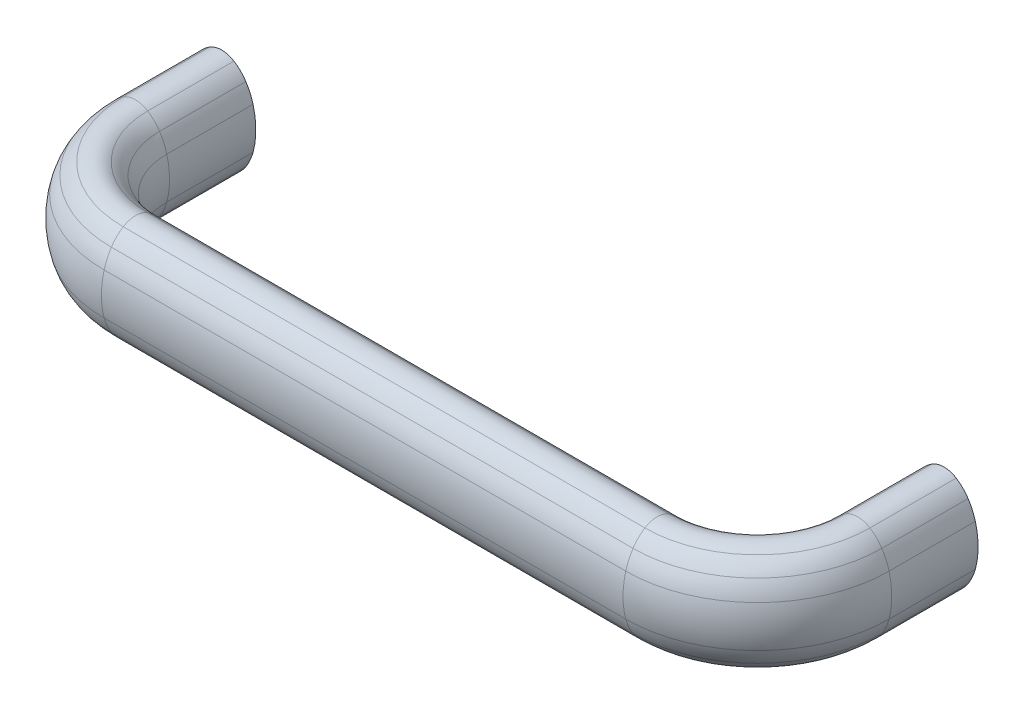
ISO-10303-21;
HEADER;
FILE_DESCRIPTION(('STEP AP214'),'2;1');
FILE_NAME('part.step','',(''),(''),'','','');
FILE_SCHEMA(('AUTOMOTIVE_DESIGN { 1 0 10303 214 1 1 1 1 }'));
ENDSEC;
DATA;
#1=APPLICATION_CONTEXT('core data for automotive mechanical design processes');
#2=APPLICATION_PROTOCOL_DEFINITION('international standard','automotive_design',2000,#1);
#3=PRODUCT_CONTEXT('',#1,'mechanical');
#4=PRODUCT('Part','Part','',(#3));
#5=PRODUCT_RELATED_PRODUCT_CATEGORY('part','',(#4));
#6=PRODUCT_DEFINITION_FORMATION('','',#4);
#7=PRODUCT_DEFINITION_CONTEXT('part definition',#1,'design');
#8=PRODUCT_DEFINITION('design','',#6,#7);
#9=PRODUCT_DEFINITION_SHAPE('','',#8);
#10=(LENGTH_UNIT() NAMED_UNIT(*) SI_UNIT(.MILLI.,.METRE.));
#11=(NAMED_UNIT(*) PLANE_ANGLE_UNIT() SI_UNIT($,.RADIAN.));
#12=(NAMED_UNIT(*) SI_UNIT($,.STERADIAN.) SOLID_ANGLE_UNIT());
#13=UNCERTAINTY_MEASURE_WITH_UNIT(LENGTH_MEASURE(1.E-05),#10,'distance_accuracy_value','');
#14=(GEOMETRIC_REPRESENTATION_CONTEXT(3) GLOBAL_UNCERTAINTY_ASSIGNED_CONTEXT((#13)) GLOBAL_UNIT_ASSIGNED_CONTEXT((#10,
#11,#12)) REPRESENTATION_CONTEXT('',''));
#15=CARTESIAN_POINT('',(0.,0.,0.));
#16=DIRECTION('',(0.,0.,1.));
#17=DIRECTION('',(1.,0.,0.));
#18=AXIS2_PLACEMENT_3D('',#15,#16,#17);
#19=CARTESIAN_POINT('',(181.10831860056,-5.5628443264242,0.));
#20=DIRECTION('',(0.,0.,-1.));
#21=DIRECTION('',(0.,-1.,0.));
#22=AXIS2_PLACEMENT_3D('',#19,#20,#21);
#23=PLANE('',#22);
#24=CARTESIAN_POINT('',(179.999387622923,-7.31331876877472,0.));
#25=DIRECTION('',(0.,0.,-1.));
#26=DIRECTION('',(0.,-1.,0.));
#27=AXIS2_PLACEMENT_3D('',#24,#25,#26);
#28=CIRCLE('',#27,5.68668538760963);
#29=CARTESIAN_POINT('',(183.042642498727,-12.1171703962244,0.));
#30=VERTEX_POINT('',#29);
#31=CARTESIAN_POINT('',(176.956132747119,-12.1171703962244,0.));
#32=VERTEX_POINT('',#31);
#33=EDGE_CURVE('E540',#30,#32,#28,.T.);
#34=ORIENTED_EDGE('',*,*,#33,.T.);
#35=CARTESIAN_POINT('',(182.217249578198,-3.81236988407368,0.));
#36=DIRECTION('',(0.,0.,-1.));
#37=DIRECTION('',(0.,-1.,0.));
#38=AXIS2_PLACEMENT_3D('',#35,#36,#37);
#39=CIRCLE('',#38,9.83102547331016);
#40=CARTESIAN_POINT('',(173.988979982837,-9.19239231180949,0.));
#41=VERTEX_POINT('',#40);
#42=EDGE_CURVE('E18',#32,#41,#39,.T.);
#43=ORIENTED_EDGE('',*,*,#42,.T.);
#44=CARTESIAN_POINT('',(185.739270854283,-1.50950981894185,0.));
#45=DIRECTION('',(0.,0.,-1.));
#46=DIRECTION('',(0.,-1.,0.));
#47=AXIS2_PLACEMENT_3D('',#44,#45,#46);
#48=CIRCLE('',#47,14.0390889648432);
#49=CARTESIAN_POINT('',(172.188367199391,-5.17952740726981,0.));
#50=VERTEX_POINT('',#49);
#51=EDGE_CURVE('E38',#41,#50,#48,.T.);
#52=ORIENTED_EDGE('',*,*,#51,.T.);
#53=CARTESIAN_POINT('',(191.312858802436,-4.15638432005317E-06,0.));
#54=DIRECTION('',(0.,0.,-1.));
#55=DIRECTION('',(0.,-1.,0.));
#56=AXIS2_PLACEMENT_3D('',#53,#54,#55);
#57=CIRCLE('',#56,19.8134711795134);
#58=CARTESIAN_POINT('',(172.188367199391,5.17951909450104,0.));
#59=VERTEX_POINT('',#58);
#60=EDGE_CURVE('E623',#50,#59,#57,.T.);
#61=ORIENTED_EDGE('',*,*,#60,.T.);
#62=CARTESIAN_POINT('',(185.739270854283,1.50950150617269,0.));
#63=DIRECTION('',(0.,0.,-1.));
#64=DIRECTION('',(0.,-1.,0.));
#65=AXIS2_PLACEMENT_3D('',#62,#63,#64);
#66=CIRCLE('',#65,14.0390889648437);
#67=CARTESIAN_POINT('',(173.988979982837,9.19238399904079,0.));
#68=VERTEX_POINT('',#67);
#69=EDGE_CURVE('E620',#59,#68,#66,.T.);
#70=ORIENTED_EDGE('',*,*,#69,.T.);
#71=CARTESIAN_POINT('',(182.217249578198,3.81236157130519,0.));
#72=DIRECTION('',(0.,0.,-1.));
#73=DIRECTION('',(0.,-1.,0.));
#74=AXIS2_PLACEMENT_3D('',#71,#72,#73);
#75=CIRCLE('',#74,9.83102547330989);
#76=CARTESIAN_POINT('',(176.956132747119,12.1171620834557,0.));
#77=VERTEX_POINT('',#76);
#78=EDGE_CURVE('E617',#68,#77,#75,.T.);
#79=ORIENTED_EDGE('',*,*,#78,.T.);
#80=CARTESIAN_POINT('',(179.999387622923,7.31331045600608,0.));
#81=DIRECTION('',(0.,0.,1.));
#82=DIRECTION('',(0.,1.,0.));
#83=AXIS2_PLACEMENT_3D('',#80,#81,#82);
#84=CIRCLE('',#83,5.68668538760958);
#85=CARTESIAN_POINT('',(183.042642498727,12.1171620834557,0.));
#86=VERTEX_POINT('',#85);
#87=EDGE_CURVE('E615',#86,#77,#84,.T.);
#88=ORIENTED_EDGE('',*,*,#87,.F.);
#89=CARTESIAN_POINT('',(177.781525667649,3.81236157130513,0.));
#90=DIRECTION('',(0.,0.,1.));
#91=DIRECTION('',(0.,1.,0.));
#92=AXIS2_PLACEMENT_3D('',#89,#90,#91);
#93=CIRCLE('',#92,9.83102547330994);
#94=CARTESIAN_POINT('',(186.009795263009,9.19238399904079,0.));
#95=VERTEX_POINT('',#94);
#96=EDGE_CURVE('E613',#95,#86,#93,.T.);
#97=ORIENTED_EDGE('',*,*,#96,.F.);
#98=CARTESIAN_POINT('',(174.259504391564,1.50950150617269,0.));
#99=DIRECTION('',(0.,0.,1.));
#100=DIRECTION('',(0.,1.,0.));
#101=AXIS2_PLACEMENT_3D('',#98,#99,#100);
#102=CIRCLE('',#101,14.0390889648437);
#103=CARTESIAN_POINT('',(187.810408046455,5.17951909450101,0.));
#104=VERTEX_POINT('',#103);
#105=EDGE_CURVE('E611',#104,#95,#102,.T.);
#106=ORIENTED_EDGE('',*,*,#105,.F.);
#107=CARTESIAN_POINT('',(168.68591644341,-4.1563845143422E-06,0.));
#108=DIRECTION('',(0.,0.,1.));
#109=DIRECTION('',(0.,1.,0.));
#110=AXIS2_PLACEMENT_3D('',#107,#108,#109);
#111=CIRCLE('',#110,19.8134711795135);
#112=CARTESIAN_POINT('',(187.810408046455,-5.17952740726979,0.));
#113=VERTEX_POINT('',#112);
#114=EDGE_CURVE('E609',#113,#104,#111,.T.);
#115=ORIENTED_EDGE('',*,*,#114,.F.);
#116=CARTESIAN_POINT('',(174.259504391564,-1.50950981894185,0.));
#117=DIRECTION('',(0.,0.,1.));
#118=DIRECTION('',(0.,1.,0.));
#119=AXIS2_PLACEMENT_3D('',#116,#117,#118);
#120=CIRCLE('',#119,14.0390889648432);
#121=CARTESIAN_POINT('',(186.009795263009,-9.19239231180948,0.));
#122=VERTEX_POINT('',#121);
#123=EDGE_CURVE('E607',#122,#113,#120,.T.);
#124=ORIENTED_EDGE('',*,*,#123,.F.);
#125=CARTESIAN_POINT('',(177.781525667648,-3.81236988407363,0.));
#126=DIRECTION('',(0.,0.,1.));
#127=DIRECTION('',(0.,1.,0.));
#128=AXIS2_PLACEMENT_3D('',#125,#126,#127);
#129=CIRCLE('',#128,9.83102547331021);
#130=EDGE_CURVE('E605',#30,#122,#129,.T.);
#131=ORIENTED_EDGE('',*,*,#130,.F.);
#132=EDGE_LOOP('',(#34,#43,#52,#61,#70,#79,#88,#97,#106,#115,#124,#131));
#133=FACE_BOUND('',#132,.T.);
#134=CARTESIAN_POINT('',(180.,0.,0.));
#135=DIRECTION('',(0.,0.,1.));
#136=DIRECTION('',(0.,1.,0.));
#137=AXIS2_PLACEMENT_3D('',#134,#135,#136);
#138=CIRCLE('',#137,4.52350000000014);
#139=CARTESIAN_POINT('',(180.,4.52350000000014,0.));
#140=VERTEX_POINT('',#139);
#141=EDGE_CURVE('E1387',#140,#140,#138,.T.);
#142=ORIENTED_EDGE('',*,*,#141,.T.);
#143=EDGE_LOOP('',(#142));
#144=FACE_BOUND('',#143,.T.);
#145=ADVANCED_FACE('F14',(#133,#144),#23,.T.);
#146=CARTESIAN_POINT('',(-1.10831860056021,-5.5628443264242,0.));
#147=DIRECTION('',(0.,0.,1.));
#148=DIRECTION('',(0.,-1.,0.));
#149=AXIS2_PLACEMENT_3D('',#146,#147,#148);
#150=PLANE('',#149);
#151=CARTESIAN_POINT('',(0.000612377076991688,-7.31331876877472,0.));
#152=DIRECTION('',(0.,0.,1.));
#153=DIRECTION('',(0.,-1.,0.));
#154=AXIS2_PLACEMENT_3D('',#151,#152,#153);
#155=CIRCLE('',#154,5.68668538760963);
#156=CARTESIAN_POINT('',(-3.04264249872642,-12.1171703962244,0.));
#157=VERTEX_POINT('',#156);
#158=CARTESIAN_POINT('',(3.04386725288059,-12.1171703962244,0.));
#159=VERTEX_POINT('',#158);
#160=EDGE_CURVE('E264',#157,#159,#155,.T.);
#161=ORIENTED_EDGE('',*,*,#160,.F.);
#162=CARTESIAN_POINT('',(2.21847433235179,-3.81236988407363,0.));
#163=DIRECTION('',(0.,0.,-1.));
#164=DIRECTION('',(0.,1.,0.));
#165=AXIS2_PLACEMENT_3D('',#162,#163,#164);
#166=CIRCLE('',#165,9.83102547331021);
#167=CARTESIAN_POINT('',(-6.00979526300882,-9.19239231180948,0.));
#168=VERTEX_POINT('',#167);
#169=EDGE_CURVE('E305',#157,#168,#166,.T.);
#170=ORIENTED_EDGE('',*,*,#169,.T.);
#171=CARTESIAN_POINT('',(5.74049560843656,-1.50950981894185,0.));
#172=DIRECTION('',(0.,0.,-1.));
#173=DIRECTION('',(0.,1.,0.));
#174=AXIS2_PLACEMENT_3D('',#171,#172,#173);
#175=CIRCLE('',#174,14.0390889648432);
#176=CARTESIAN_POINT('',(-7.81040804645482,-5.17952740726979,0.));
#177=VERTEX_POINT('',#176);
#178=EDGE_CURVE('E302',#168,#177,#175,.T.);
#179=ORIENTED_EDGE('',*,*,#178,.T.);
#180=CARTESIAN_POINT('',(11.3140835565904,-4.1563845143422E-06,0.));
#181=DIRECTION('',(0.,0.,-1.));
#182=DIRECTION('',(0.,1.,0.));
#183=AXIS2_PLACEMENT_3D('',#180,#181,#182);
#184=CIRCLE('',#183,19.8134711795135);
#185=CARTESIAN_POINT('',(-7.81040804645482,5.17951909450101,0.));
#186=VERTEX_POINT('',#185);
#187=EDGE_CURVE('E299',#177,#186,#184,.T.);
#188=ORIENTED_EDGE('',*,*,#187,.T.);
#189=CARTESIAN_POINT('',(5.74049560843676,1.50950150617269,0.));
#190=DIRECTION('',(0.,0.,-1.));
#191=DIRECTION('',(0.,1.,0.));
#192=AXIS2_PLACEMENT_3D('',#189,#190,#191);
#193=CIRCLE('',#192,14.0390889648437);
#194=CARTESIAN_POINT('',(-6.00979526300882,9.19238399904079,0.));
#195=VERTEX_POINT('',#194);
#196=EDGE_CURVE('E296',#186,#195,#193,.T.);
#197=ORIENTED_EDGE('',*,*,#196,.T.);
#198=CARTESIAN_POINT('',(2.21847433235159,3.81236157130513,0.));
#199=DIRECTION('',(0.,0.,-1.));
#200=DIRECTION('',(0.,1.,0.));
#201=AXIS2_PLACEMENT_3D('',#198,#199,#200);
#202=CIRCLE('',#201,9.83102547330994);
#203=CARTESIAN_POINT('',(-3.04264249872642,12.1171620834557,0.));
#204=VERTEX_POINT('',#203);
#205=EDGE_CURVE('E293',#195,#204,#202,.T.);
#206=ORIENTED_EDGE('',*,*,#205,.T.);
#207=CARTESIAN_POINT('',(0.000612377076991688,7.31331045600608,0.));
#208=DIRECTION('',(0.,0.,1.));
#209=DIRECTION('',(0.,-1.,0.));
#210=AXIS2_PLACEMENT_3D('',#207,#208,#209);
#211=CIRCLE('',#210,5.68668538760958);
#212=CARTESIAN_POINT('',(3.04386725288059,12.1171620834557,0.));
#213=VERTEX_POINT('',#212);
#214=EDGE_CURVE('E291',#213,#204,#211,.T.);
#215=ORIENTED_EDGE('',*,*,#214,.F.);
#216=CARTESIAN_POINT('',(-2.21724957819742,3.81236157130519,0.));
#217=DIRECTION('',(0.,0.,1.));
#218=DIRECTION('',(0.,-1.,0.));
#219=AXIS2_PLACEMENT_3D('',#216,#217,#218);
#220=CIRCLE('',#219,9.83102547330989);
#221=CARTESIAN_POINT('',(6.01102001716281,9.19238399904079,0.));
#222=VERTEX_POINT('',#221);
#223=EDGE_CURVE('E288',#222,#213,#220,.T.);
#224=ORIENTED_EDGE('',*,*,#223,.F.);
#225=CARTESIAN_POINT('',(-5.73927085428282,1.50950150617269,0.));
#226=DIRECTION('',(0.,0.,1.));
#227=DIRECTION('',(0.,-1.,0.));
#228=AXIS2_PLACEMENT_3D('',#225,#226,#227);
#229=CIRCLE('',#228,14.0390889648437);
#230=CARTESIAN_POINT('',(7.81163280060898,5.17951909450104,0.));
#231=VERTEX_POINT('',#230);
#232=EDGE_CURVE('E285',#231,#222,#229,.T.);
#233=ORIENTED_EDGE('',*,*,#232,.F.);
#234=CARTESIAN_POINT('',(-11.3128588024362,-4.15638432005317E-06,0.));
#235=DIRECTION('',(0.,0.,1.));
#236=DIRECTION('',(0.,-1.,0.));
#237=AXIS2_PLACEMENT_3D('',#234,#235,#236);
#238=CIRCLE('',#237,19.8134711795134);
#239=CARTESIAN_POINT('',(7.81163280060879,-5.17952740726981,0.));
#240=VERTEX_POINT('',#239);
#241=EDGE_CURVE('E279',#240,#231,#238,.T.);
#242=ORIENTED_EDGE('',*,*,#241,.F.);
#243=CARTESIAN_POINT('',(-5.73927085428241,-1.50950981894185,0.));
#244=DIRECTION('',(0.,0.,1.));
#245=DIRECTION('',(0.,-1.,0.));
#246=AXIS2_PLACEMENT_3D('',#243,#244,#245);
#247=CIRCLE('',#246,14.0390889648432);
#248=CARTESIAN_POINT('',(6.01102001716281,-9.19239231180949,0.));
#249=VERTEX_POINT('',#248);
#250=EDGE_CURVE('E277',#249,#240,#247,.T.);
#251=ORIENTED_EDGE('',*,*,#250,.F.);
#252=CARTESIAN_POINT('',(-2.21724957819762,-3.81236988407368,0.));
#253=DIRECTION('',(0.,0.,1.));
#254=DIRECTION('',(0.,-1.,0.));
#255=AXIS2_PLACEMENT_3D('',#252,#253,#254);
#256=CIRCLE('',#255,9.83102547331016);
#257=EDGE_CURVE('E255',#159,#249,#256,.T.);
#258=ORIENTED_EDGE('',*,*,#257,.F.);
#259=EDGE_LOOP('',(#161,#170,#179,#188,#197,#206,#215,#224,#233,#242,#251,#258));
#260=FACE_BOUND('',#259,.T.);
#261=CARTESIAN_POINT('',(0.,0.,0.));
#262=DIRECTION('',(0.,0.,-1.));
#263=DIRECTION('',(0.,1.,0.));
#264=AXIS2_PLACEMENT_3D('',#261,#262,#263);
#265=CIRCLE('',#264,4.52350000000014);
#266=CARTESIAN_POINT('',(0.,4.52350000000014,0.));
#267=VERTEX_POINT('',#266);
#268=EDGE_CURVE('E271',#267,#267,#265,.T.);
#269=ORIENTED_EDGE('',*,*,#268,.F.);
#270=EDGE_LOOP('',(#269));
#271=FACE_BOUND('',#270,.T.);
#272=ADVANCED_FACE('F273',(#260,#271),#150,.F.);
#273=CARTESIAN_POINT('',(182.217249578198,-3.81236988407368,21.5));
#274=DIRECTION('',(0.,0.,-1.));
#275=DIRECTION('',(0.,1.,0.));
#276=AXIS2_PLACEMENT_3D('',#273,#274,#275);
#277=CYLINDRICAL_SURFACE('',#276,9.83102547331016);
#278=CARTESIAN_POINT('',(182.217249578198,-3.81236988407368,21.5));
#279=DIRECTION('',(0.,0.,-1.));
#280=DIRECTION('',(0.,-1.,0.));
#281=AXIS2_PLACEMENT_3D('',#278,#279,#280);
#282=CIRCLE('',#281,9.83102547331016);
#283=CARTESIAN_POINT('',(176.956132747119,-12.1171703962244,21.5));
#284=VERTEX_POINT('',#283);
#285=CARTESIAN_POINT('',(173.988979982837,-9.19239231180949,21.5));
#286=VERTEX_POINT('',#285);
#287=EDGE_CURVE('E507',#284,#286,#282,.T.);
#288=ORIENTED_EDGE('',*,*,#287,.T.);
#289=DIRECTION('',(0.,0.,-1.));
#290=VECTOR('',#289,1.);
#291=CARTESIAN_POINT('',(173.988979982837,-9.19239231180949,21.5));
#292=LINE('',#291,#290);
#293=EDGE_CURVE('E23',#286,#41,#292,.T.);
#294=ORIENTED_EDGE('',*,*,#293,.T.);
#295=ORIENTED_EDGE('',*,*,#42,.F.);
#296=DIRECTION('',(0.,0.,-1.));
#297=VECTOR('',#296,1.);
#298=CARTESIAN_POINT('',(176.956132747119,-12.1171703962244,21.5));
#299=LINE('',#298,#297);
#300=EDGE_CURVE('E9',#284,#32,#299,.T.);
#301=ORIENTED_EDGE('',*,*,#300,.F.);
#302=EDGE_LOOP('',(#288,#294,#295,#301));
#303=FACE_BOUND('',#302,.T.);
#304=ADVANCED_FACE('F16',(#303),#277,.T.);
#305=CARTESIAN_POINT('',(185.739270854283,-1.50950981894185,21.5));
#306=DIRECTION('',(0.,0.,-1.));
#307=DIRECTION('',(0.,1.,0.));
#308=AXIS2_PLACEMENT_3D('',#305,#306,#307);
#309=CYLINDRICAL_SURFACE('',#308,14.0390889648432);
#310=CARTESIAN_POINT('',(185.739270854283,-1.50950981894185,21.5));
#311=DIRECTION('',(0.,0.,-1.));
#312=DIRECTION('',(0.,-1.,0.));
#313=AXIS2_PLACEMENT_3D('',#310,#311,#312);
#314=CIRCLE('',#313,14.0390889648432);
#315=CARTESIAN_POINT('',(172.188367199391,-5.17952740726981,21.5));
#316=VERTEX_POINT('',#315);
#317=EDGE_CURVE('E569',#286,#316,#314,.T.);
#318=ORIENTED_EDGE('',*,*,#317,.T.);
#319=DIRECTION('',(0.,0.,-1.));
#320=VECTOR('',#319,1.);
#321=CARTESIAN_POINT('',(172.188367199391,-5.17952740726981,21.5));
#322=LINE('',#321,#320);
#323=EDGE_CURVE('E601',#316,#50,#322,.T.);
#324=ORIENTED_EDGE('',*,*,#323,.T.);
#325=ORIENTED_EDGE('',*,*,#51,.F.);
#326=ORIENTED_EDGE('',*,*,#293,.F.);
#327=EDGE_LOOP('',(#318,#324,#325,#326));
#328=FACE_BOUND('',#327,.T.);
#329=ADVANCED_FACE('F630',(#328),#309,.T.);
#330=CARTESIAN_POINT('',(191.312858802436,-4.15638432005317E-06,21.5));
#331=DIRECTION('',(0.,0.,-1.));
#332=DIRECTION('',(0.,1.,0.));
#333=AXIS2_PLACEMENT_3D('',#330,#331,#332);
#334=CYLINDRICAL_SURFACE('',#333,19.8134711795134);
#335=CARTESIAN_POINT('',(191.312858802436,-4.15638432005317E-06,21.5));
#336=DIRECTION('',(0.,0.,-1.));
#337=DIRECTION('',(0.,-1.,0.));
#338=AXIS2_PLACEMENT_3D('',#335,#336,#337);
#339=CIRCLE('',#338,19.8134711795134);
#340=CARTESIAN_POINT('',(172.188367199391,5.17951909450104,21.5));
#341=VERTEX_POINT('',#340);
#342=EDGE_CURVE('E566',#316,#341,#339,.T.);
#343=ORIENTED_EDGE('',*,*,#342,.T.);
#344=DIRECTION('',(0.,0.,-1.));
#345=VECTOR('',#344,1.);
#346=CARTESIAN_POINT('',(172.188367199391,5.17951909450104,21.5));
#347=LINE('',#346,#345);
#348=EDGE_CURVE('E598',#341,#59,#347,.T.);
#349=ORIENTED_EDGE('',*,*,#348,.T.);
#350=ORIENTED_EDGE('',*,*,#60,.F.);
#351=ORIENTED_EDGE('',*,*,#323,.F.);
#352=EDGE_LOOP('',(#343,#349,#350,#351));
#353=FACE_BOUND('',#352,.T.);
#354=ADVANCED_FACE('F685',(#353),#334,.T.);
#355=CARTESIAN_POINT('',(185.739270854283,1.50950150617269,21.5));
#356=DIRECTION('',(0.,0.,-1.));
#357=DIRECTION('',(0.,1.,0.));
#358=AXIS2_PLACEMENT_3D('',#355,#356,#357);
#359=CYLINDRICAL_SURFACE('',#358,14.0390889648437);
#360=CARTESIAN_POINT('',(185.739270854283,1.50950150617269,21.5));
#361=DIRECTION('',(0.,0.,-1.));
#362=DIRECTION('',(0.,-1.,0.));
#363=AXIS2_PLACEMENT_3D('',#360,#361,#362);
#364=CIRCLE('',#363,14.0390889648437);
#365=CARTESIAN_POINT('',(173.988979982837,9.19238399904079,21.5));
#366=VERTEX_POINT('',#365);
#367=EDGE_CURVE('E563',#341,#366,#364,.T.);
#368=ORIENTED_EDGE('',*,*,#367,.T.);
#369=DIRECTION('',(0.,0.,-1.));
#370=VECTOR('',#369,1.);
#371=CARTESIAN_POINT('',(173.988979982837,9.19238399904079,21.5));
#372=LINE('',#371,#370);
#373=EDGE_CURVE('E595',#366,#68,#372,.T.);
#374=ORIENTED_EDGE('',*,*,#373,.T.);
#375=ORIENTED_EDGE('',*,*,#69,.F.);
#376=ORIENTED_EDGE('',*,*,#348,.F.);
#377=EDGE_LOOP('',(#368,#374,#375,#376));
#378=FACE_BOUND('',#377,.T.);
#379=ADVANCED_FACE('F684',(#378),#359,.T.);
#380=CARTESIAN_POINT('',(182.217249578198,3.81236157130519,21.5));
#381=DIRECTION('',(0.,0.,-1.));
#382=DIRECTION('',(0.,1.,0.));
#383=AXIS2_PLACEMENT_3D('',#380,#381,#382);
#384=CYLINDRICAL_SURFACE('',#383,9.83102547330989);
#385=CARTESIAN_POINT('',(182.217249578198,3.81236157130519,21.5));
#386=DIRECTION('',(0.,0.,-1.));
#387=DIRECTION('',(0.,-1.,0.));
#388=AXIS2_PLACEMENT_3D('',#385,#386,#387);
#389=CIRCLE('',#388,9.83102547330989);
#390=CARTESIAN_POINT('',(176.956132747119,12.1171620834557,21.5));
#391=VERTEX_POINT('',#390);
#392=EDGE_CURVE('E560',#366,#391,#389,.T.);
#393=ORIENTED_EDGE('',*,*,#392,.T.);
#394=DIRECTION('',(0.,0.,-1.));
#395=VECTOR('',#394,1.);
#396=CARTESIAN_POINT('',(176.956132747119,12.1171620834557,21.5));
#397=LINE('',#396,#395);
#398=EDGE_CURVE('E592',#391,#77,#397,.T.);
#399=ORIENTED_EDGE('',*,*,#398,.T.);
#400=ORIENTED_EDGE('',*,*,#78,.F.);
#401=ORIENTED_EDGE('',*,*,#373,.F.);
#402=EDGE_LOOP('',(#393,#399,#400,#401));
#403=FACE_BOUND('',#402,.T.);
#404=ADVANCED_FACE('F690',(#403),#384,.T.);
#405=CARTESIAN_POINT('',(179.999387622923,7.31331045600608,21.5));
#406=DIRECTION('',(0.,0.,-1.));
#407=DIRECTION('',(0.,1.,0.));
#408=AXIS2_PLACEMENT_3D('',#405,#406,#407);
#409=CYLINDRICAL_SURFACE('',#408,5.68668538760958);
#410=CARTESIAN_POINT('',(179.999387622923,7.31331045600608,21.5));
#411=DIRECTION('',(0.,0.,1.));
#412=DIRECTION('',(0.,1.,0.));
#413=AXIS2_PLACEMENT_3D('',#410,#411,#412);
#414=CIRCLE('',#413,5.68668538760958);
#415=CARTESIAN_POINT('',(183.042642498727,12.1171620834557,21.5));
#416=VERTEX_POINT('',#415);
#417=EDGE_CURVE('E558',#416,#391,#414,.T.);
#418=ORIENTED_EDGE('',*,*,#417,.F.);
#419=DIRECTION('',(0.,0.,-1.));
#420=VECTOR('',#419,1.);
#421=CARTESIAN_POINT('',(183.042642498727,12.1171620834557,21.5));
#422=LINE('',#421,#420);
#423=EDGE_CURVE('E589',#416,#86,#422,.T.);
#424=ORIENTED_EDGE('',*,*,#423,.T.);
#425=ORIENTED_EDGE('',*,*,#87,.T.);
#426=ORIENTED_EDGE('',*,*,#398,.F.);
#427=EDGE_LOOP('',(#418,#424,#425,#426));
#428=FACE_BOUND('',#427,.T.);
#429=ADVANCED_FACE('F693',(#428),#409,.T.);
#430=CARTESIAN_POINT('',(177.781525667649,3.81236157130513,21.5));
#431=DIRECTION('',(0.,0.,-1.));
#432=DIRECTION('',(0.,1.,0.));
#433=AXIS2_PLACEMENT_3D('',#430,#431,#432);
#434=CYLINDRICAL_SURFACE('',#433,9.83102547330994);
#435=CARTESIAN_POINT('',(177.781525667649,3.81236157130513,21.5));
#436=DIRECTION('',(0.,0.,1.));
#437=DIRECTION('',(0.,1.,0.));
#438=AXIS2_PLACEMENT_3D('',#435,#436,#437);
#439=CIRCLE('',#438,9.83102547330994);
#440=CARTESIAN_POINT('',(186.009795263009,9.19238399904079,21.5));
#441=VERTEX_POINT('',#440);
#442=EDGE_CURVE('E555',#441,#416,#439,.T.);
#443=ORIENTED_EDGE('',*,*,#442,.F.);
#444=DIRECTION('',(0.,0.,-1.));
#445=VECTOR('',#444,1.);
#446=CARTESIAN_POINT('',(186.009795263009,9.19238399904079,21.5));
#447=LINE('',#446,#445);
#448=EDGE_CURVE('E586',#441,#95,#447,.T.);
#449=ORIENTED_EDGE('',*,*,#448,.T.);
#450=ORIENTED_EDGE('',*,*,#96,.T.);
#451=ORIENTED_EDGE('',*,*,#423,.F.);
#452=EDGE_LOOP('',(#443,#449,#450,#451));
#453=FACE_BOUND('',#452,.T.);
#454=ADVANCED_FACE('F696',(#453),#434,.T.);
#455=CARTESIAN_POINT('',(174.259504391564,1.50950150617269,21.5));
#456=DIRECTION('',(0.,0.,-1.));
#457=DIRECTION('',(0.,1.,0.));
#458=AXIS2_PLACEMENT_3D('',#455,#456,#457);
#459=CYLINDRICAL_SURFACE('',#458,14.0390889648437);
#460=CARTESIAN_POINT('',(174.259504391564,1.50950150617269,21.5));
#461=DIRECTION('',(0.,0.,1.));
#462=DIRECTION('',(0.,1.,0.));
#463=AXIS2_PLACEMENT_3D('',#460,#461,#462);
#464=CIRCLE('',#463,14.0390889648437);
#465=CARTESIAN_POINT('',(187.810408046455,5.17951909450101,21.5));
#466=VERTEX_POINT('',#465);
#467=EDGE_CURVE('E552',#466,#441,#464,.T.);
#468=ORIENTED_EDGE('',*,*,#467,.F.);
#469=DIRECTION('',(0.,0.,-1.));
#470=VECTOR('',#469,1.);
#471=CARTESIAN_POINT('',(187.810408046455,5.17951909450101,21.5));
#472=LINE('',#471,#470);
#473=EDGE_CURVE('E583',#466,#104,#472,.T.);
#474=ORIENTED_EDGE('',*,*,#473,.T.);
#475=ORIENTED_EDGE('',*,*,#105,.T.);
#476=ORIENTED_EDGE('',*,*,#448,.F.);
#477=EDGE_LOOP('',(#468,#474,#475,#476));
#478=FACE_BOUND('',#477,.T.);
#479=ADVANCED_FACE('F702',(#478),#459,.T.);
#480=CARTESIAN_POINT('',(168.68591644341,-4.1563845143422E-06,21.5));
#481=DIRECTION('',(0.,0.,-1.));
#482=DIRECTION('',(0.,1.,0.));
#483=AXIS2_PLACEMENT_3D('',#480,#481,#482);
#484=CYLINDRICAL_SURFACE('',#483,19.8134711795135);
#485=CARTESIAN_POINT('',(168.68591644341,-4.1563845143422E-06,21.5));
#486=DIRECTION('',(0.,0.,1.));
#487=DIRECTION('',(0.,1.,0.));
#488=AXIS2_PLACEMENT_3D('',#485,#486,#487);
#489=CIRCLE('',#488,19.8134711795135);
#490=CARTESIAN_POINT('',(187.810408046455,-5.17952740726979,21.5));
#491=VERTEX_POINT('',#490);
#492=EDGE_CURVE('E549',#491,#466,#489,.T.);
#493=ORIENTED_EDGE('',*,*,#492,.F.);
#494=DIRECTION('',(0.,0.,-1.));
#495=VECTOR('',#494,1.);
#496=CARTESIAN_POINT('',(187.810408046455,-5.17952740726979,21.5));
#497=LINE('',#496,#495);
#498=EDGE_CURVE('E580',#491,#113,#497,.T.);
#499=ORIENTED_EDGE('',*,*,#498,.T.);
#500=ORIENTED_EDGE('',*,*,#114,.T.);
#501=ORIENTED_EDGE('',*,*,#473,.F.);
#502=EDGE_LOOP('',(#493,#499,#500,#501));
#503=FACE_BOUND('',#502,.T.);
#504=ADVANCED_FACE('F705',(#503),#484,.T.);
#505=CARTESIAN_POINT('',(174.259504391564,-1.50950981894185,21.5));
#506=DIRECTION('',(0.,0.,-1.));
#507=DIRECTION('',(0.,1.,0.));
#508=AXIS2_PLACEMENT_3D('',#505,#506,#507);
#509=CYLINDRICAL_SURFACE('',#508,14.0390889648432);
#510=CARTESIAN_POINT('',(174.259504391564,-1.50950981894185,21.5));
#511=DIRECTION('',(0.,0.,1.));
#512=DIRECTION('',(0.,1.,0.));
#513=AXIS2_PLACEMENT_3D('',#510,#511,#512);
#514=CIRCLE('',#513,14.0390889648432);
#515=CARTESIAN_POINT('',(186.009795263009,-9.19239231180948,21.5));
#516=VERTEX_POINT('',#515);
#517=EDGE_CURVE('E546',#516,#491,#514,.T.);
#518=ORIENTED_EDGE('',*,*,#517,.F.);
#519=DIRECTION('',(0.,0.,-1.));
#520=VECTOR('',#519,1.);
#521=CARTESIAN_POINT('',(186.009795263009,-9.19239231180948,21.5));
#522=LINE('',#521,#520);
#523=EDGE_CURVE('E577',#516,#122,#522,.T.);
#524=ORIENTED_EDGE('',*,*,#523,.T.);
#525=ORIENTED_EDGE('',*,*,#123,.T.);
#526=ORIENTED_EDGE('',*,*,#498,.F.);
#527=EDGE_LOOP('',(#518,#524,#525,#526));
#528=FACE_BOUND('',#527,.T.);
#529=ADVANCED_FACE('F708',(#528),#509,.T.);
#530=CARTESIAN_POINT('',(177.781525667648,-3.81236988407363,21.5));
#531=DIRECTION('',(0.,0.,-1.));
#532=DIRECTION('',(0.,1.,0.));
#533=AXIS2_PLACEMENT_3D('',#530,#531,#532);
#534=CYLINDRICAL_SURFACE('',#533,9.83102547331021);
#535=CARTESIAN_POINT('',(177.781525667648,-3.81236988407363,21.5));
#536=DIRECTION('',(0.,0.,1.));
#537=DIRECTION('',(0.,1.,0.));
#538=AXIS2_PLACEMENT_3D('',#535,#536,#537);
#539=CIRCLE('',#538,9.83102547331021);
#540=CARTESIAN_POINT('',(183.042642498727,-12.1171703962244,21.5));
#541=VERTEX_POINT('',#540);
#542=EDGE_CURVE('E543',#541,#516,#539,.T.);
#543=ORIENTED_EDGE('',*,*,#542,.F.);
#544=DIRECTION('',(0.,0.,-1.));
#545=VECTOR('',#544,1.);
#546=CARTESIAN_POINT('',(183.042642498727,-12.1171703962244,21.5));
#547=LINE('',#546,#545);
#548=EDGE_CURVE('E574',#541,#30,#547,.T.);
#549=ORIENTED_EDGE('',*,*,#548,.T.);
#550=ORIENTED_EDGE('',*,*,#130,.T.);
#551=ORIENTED_EDGE('',*,*,#523,.F.);
#552=EDGE_LOOP('',(#543,#549,#550,#551));
#553=FACE_BOUND('',#552,.T.);
#554=ADVANCED_FACE('F712',(#553),#534,.T.);
#555=CARTESIAN_POINT('',(179.999387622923,-7.31331876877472,21.5));
#556=DIRECTION('',(0.,0.,-1.));
#557=DIRECTION('',(0.,1.,0.));
#558=AXIS2_PLACEMENT_3D('',#555,#556,#557);
#559=CYLINDRICAL_SURFACE('',#558,5.68668538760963);
#560=CARTESIAN_POINT('',(179.999387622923,-7.31331876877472,21.5));
#561=DIRECTION('',(0.,0.,-1.));
#562=DIRECTION('',(0.,-1.,0.));
#563=AXIS2_PLACEMENT_3D('',#560,#561,#562);
#564=CIRCLE('',#563,5.68668538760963);
#565=EDGE_CURVE('E469',#541,#284,#564,.T.);
#566=ORIENTED_EDGE('',*,*,#565,.T.);
#567=ORIENTED_EDGE('',*,*,#300,.T.);
#568=ORIENTED_EDGE('',*,*,#33,.F.);
#569=ORIENTED_EDGE('',*,*,#548,.F.);
#570=EDGE_LOOP('',(#566,#567,#568,#569));
#571=FACE_BOUND('',#570,.T.);
#572=ADVANCED_FACE('F714',(#571),#559,.T.);
#573=CARTESIAN_POINT('',(155.,-3.81236988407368,21.5));
#574=DIRECTION('',(0.,1.,0.));
#575=DIRECTION('',(-1.,0.,0.));
#576=AXIS2_PLACEMENT_3D('',#573,#574,#575);
#577=TOROIDAL_SURFACE('',#576,27.2172495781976,9.83102547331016);
#578=CARTESIAN_POINT('',(155.,-3.81236988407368,48.7172495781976));
#579=DIRECTION('',(1.,0.,0.));
#580=DIRECTION('',(0.,-1.,0.));
#581=AXIS2_PLACEMENT_3D('',#578,#579,#580);
#582=CIRCLE('',#581,9.83102547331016);
#583=CARTESIAN_POINT('',(155.,-12.1171703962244,43.4561327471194));
#584=VERTEX_POINT('',#583);
#585=CARTESIAN_POINT('',(155.,-9.19239231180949,40.4889799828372));
#586=VERTEX_POINT('',#585);
#587=EDGE_CURVE('E436',#584,#586,#582,.T.);
#588=ORIENTED_EDGE('',*,*,#587,.T.);
#589=CARTESIAN_POINT('',(155.,-9.19239231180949,21.5));
#590=DIRECTION('',(0.,1.,0.));
#591=DIRECTION('',(-1.,0.,0.));
#592=AXIS2_PLACEMENT_3D('',#589,#590,#591);
#593=CIRCLE('',#592,18.9889799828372);
#594=EDGE_CURVE('E534',#586,#286,#593,.T.);
#595=ORIENTED_EDGE('',*,*,#594,.T.);
#596=ORIENTED_EDGE('',*,*,#287,.F.);
#597=CARTESIAN_POINT('',(155.,-12.1171703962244,21.5));
#598=DIRECTION('',(0.,1.,0.));
#599=DIRECTION('',(-1.,0.,0.));
#600=AXIS2_PLACEMENT_3D('',#597,#598,#599);
#601=CIRCLE('',#600,21.9561327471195);
#602=EDGE_CURVE('E537',#584,#284,#601,.T.);
#603=ORIENTED_EDGE('',*,*,#602,.F.);
#604=EDGE_LOOP('',(#588,#595,#596,#603));
#605=FACE_BOUND('',#604,.T.);
#606=ADVANCED_FACE('F718',(#605),#577,.T.);
#607=CARTESIAN_POINT('',(155.,-1.50950981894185,21.5));
#608=DIRECTION('',(0.,1.,0.));
#609=DIRECTION('',(-1.,0.,0.));
#610=AXIS2_PLACEMENT_3D('',#607,#608,#609);
#611=TOROIDAL_SURFACE('',#610,30.7392708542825,14.0390889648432);
#612=CARTESIAN_POINT('',(155.,-1.50950981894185,52.2392708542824));
#613=DIRECTION('',(1.,0.,0.));
#614=DIRECTION('',(0.,-1.,0.));
#615=AXIS2_PLACEMENT_3D('',#612,#613,#614);
#616=CIRCLE('',#615,14.0390889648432);
#617=CARTESIAN_POINT('',(155.,-5.17952740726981,38.6883671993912));
#618=VERTEX_POINT('',#617);
#619=EDGE_CURVE('E498',#586,#618,#616,.T.);
#620=ORIENTED_EDGE('',*,*,#619,.T.);
#621=CARTESIAN_POINT('',(155.,-5.17952740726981,21.5));
#622=DIRECTION('',(0.,1.,0.));
#623=DIRECTION('',(-1.,0.,0.));
#624=AXIS2_PLACEMENT_3D('',#621,#622,#623);
#625=CIRCLE('',#624,17.1883671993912);
#626=EDGE_CURVE('E531',#618,#316,#625,.T.);
#627=ORIENTED_EDGE('',*,*,#626,.T.);
#628=ORIENTED_EDGE('',*,*,#317,.F.);
#629=ORIENTED_EDGE('',*,*,#594,.F.);
#630=EDGE_LOOP('',(#620,#627,#628,#629));
#631=FACE_BOUND('',#630,.T.);
#632=ADVANCED_FACE('F637',(#631),#611,.T.);
#633=CARTESIAN_POINT('',(155.,-4.15638432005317E-06,21.5));
#634=DIRECTION('',(0.,1.,0.));
#635=DIRECTION('',(-1.,0.,0.));
#636=AXIS2_PLACEMENT_3D('',#633,#634,#635);
#637=TOROIDAL_SURFACE('',#636,36.3128588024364,19.8134711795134);
#638=CARTESIAN_POINT('',(155.,-4.15638432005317E-06,57.8128588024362));
#639=DIRECTION('',(1.,0.,0.));
#640=DIRECTION('',(0.,-1.,0.));
#641=AXIS2_PLACEMENT_3D('',#638,#639,#640);
#642=CIRCLE('',#641,19.8134711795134);
#643=CARTESIAN_POINT('',(155.,5.17951909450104,38.6883671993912));
#644=VERTEX_POINT('',#643);
#645=EDGE_CURVE('E495',#618,#644,#642,.T.);
#646=ORIENTED_EDGE('',*,*,#645,.T.);
#647=CARTESIAN_POINT('',(155.,5.17951909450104,21.5));
#648=DIRECTION('',(0.,1.,0.));
#649=DIRECTION('',(-1.,0.,0.));
#650=AXIS2_PLACEMENT_3D('',#647,#648,#649);
#651=CIRCLE('',#650,17.1883671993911);
#652=EDGE_CURVE('E528',#644,#341,#651,.T.);
#653=ORIENTED_EDGE('',*,*,#652,.T.);
#654=ORIENTED_EDGE('',*,*,#342,.F.);
#655=ORIENTED_EDGE('',*,*,#626,.F.);
#656=EDGE_LOOP('',(#646,#653,#654,#655));
#657=FACE_BOUND('',#656,.T.);
#658=ADVANCED_FACE('F634',(#657),#637,.T.);
#659=CARTESIAN_POINT('',(155.,1.50950150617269,21.5));
#660=DIRECTION('',(0.,1.,0.));
#661=DIRECTION('',(-1.,0.,0.));
#662=AXIS2_PLACEMENT_3D('',#659,#660,#661);
#663=TOROIDAL_SURFACE('',#662,30.7392708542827,14.0390889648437);
#664=CARTESIAN_POINT('',(155.,1.50950150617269,52.2392708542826));
#665=DIRECTION('',(1.,0.,0.));
#666=DIRECTION('',(0.,-1.,0.));
#667=AXIS2_PLACEMENT_3D('',#664,#665,#666);
#668=CIRCLE('',#667,14.0390889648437);
#669=CARTESIAN_POINT('',(155.,9.19238399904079,40.4889799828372));
#670=VERTEX_POINT('',#669);
#671=EDGE_CURVE('E492',#644,#670,#668,.T.);
#672=ORIENTED_EDGE('',*,*,#671,.T.);
#673=CARTESIAN_POINT('',(155.,9.19238399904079,21.5));
#674=DIRECTION('',(0.,1.,0.));
#675=DIRECTION('',(-1.,0.,0.));
#676=AXIS2_PLACEMENT_3D('',#673,#674,#675);
#677=CIRCLE('',#676,18.9889799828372);
#678=EDGE_CURVE('E525',#670,#366,#677,.T.);
#679=ORIENTED_EDGE('',*,*,#678,.T.);
#680=ORIENTED_EDGE('',*,*,#367,.F.);
#681=ORIENTED_EDGE('',*,*,#652,.F.);
#682=EDGE_LOOP('',(#672,#679,#680,#681));
#683=FACE_BOUND('',#682,.T.);
#684=ADVANCED_FACE('F682',(#683),#663,.T.);
#685=CARTESIAN_POINT('',(155.,3.81236157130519,21.5));
#686=DIRECTION('',(0.,1.,0.));
#687=DIRECTION('',(-1.,0.,0.));
#688=AXIS2_PLACEMENT_3D('',#685,#686,#687);
#689=TOROIDAL_SURFACE('',#688,27.2172495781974,9.83102547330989);
#690=CARTESIAN_POINT('',(155.,3.81236157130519,48.7172495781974));
#691=DIRECTION('',(1.,0.,0.));
#692=DIRECTION('',(0.,-1.,0.));
#693=AXIS2_PLACEMENT_3D('',#690,#691,#692);
#694=CIRCLE('',#693,9.83102547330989);
#695=CARTESIAN_POINT('',(155.,12.1171620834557,43.4561327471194));
#696=VERTEX_POINT('',#695);
#697=EDGE_CURVE('E489',#670,#696,#694,.T.);
#698=ORIENTED_EDGE('',*,*,#697,.T.);
#699=CARTESIAN_POINT('',(155.,12.1171620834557,21.5));
#700=DIRECTION('',(0.,1.,0.));
#701=DIRECTION('',(-1.,0.,0.));
#702=AXIS2_PLACEMENT_3D('',#699,#700,#701);
#703=CIRCLE('',#702,21.9561327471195);
#704=EDGE_CURVE('E522',#696,#391,#703,.T.);
#705=ORIENTED_EDGE('',*,*,#704,.T.);
#706=ORIENTED_EDGE('',*,*,#392,.F.);
#707=ORIENTED_EDGE('',*,*,#678,.F.);
#708=EDGE_LOOP('',(#698,#705,#706,#707));
#709=FACE_BOUND('',#708,.T.);
#710=ADVANCED_FACE('F678',(#709),#689,.T.);
#711=CARTESIAN_POINT('',(155.,7.31331045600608,21.5));
#712=DIRECTION('',(0.,1.,0.));
#713=DIRECTION('',(-1.,0.,0.));
#714=AXIS2_PLACEMENT_3D('',#711,#712,#713);
#715=TOROIDAL_SURFACE('',#714,24.999387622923,5.68668538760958);
#716=CARTESIAN_POINT('',(155.,7.31331045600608,46.499387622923));
#717=DIRECTION('',(-1.,0.,0.));
#718=DIRECTION('',(0.,1.,0.));
#719=AXIS2_PLACEMENT_3D('',#716,#717,#718);
#720=CIRCLE('',#719,5.68668538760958);
#721=CARTESIAN_POINT('',(155.,12.1171620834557,49.5426424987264));
#722=VERTEX_POINT('',#721);
#723=EDGE_CURVE('E487',#722,#696,#720,.T.);
#724=ORIENTED_EDGE('',*,*,#723,.F.);
#725=CARTESIAN_POINT('',(155.,12.1171620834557,21.5));
#726=DIRECTION('',(0.,1.,0.));
#727=DIRECTION('',(-1.,0.,0.));
#728=AXIS2_PLACEMENT_3D('',#725,#726,#727);
#729=CIRCLE('',#728,28.0426424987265);
#730=EDGE_CURVE('E519',#722,#416,#729,.T.);
#731=ORIENTED_EDGE('',*,*,#730,.T.);
#732=ORIENTED_EDGE('',*,*,#417,.T.);
#733=ORIENTED_EDGE('',*,*,#704,.F.);
#734=EDGE_LOOP('',(#724,#731,#732,#733));
#735=FACE_BOUND('',#734,.T.);
#736=ADVANCED_FACE('F1023',(#735),#715,.T.);
#737=CARTESIAN_POINT('',(155.,3.81236157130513,21.5));
#738=DIRECTION('',(0.,1.,0.));
#739=DIRECTION('',(-1.,0.,0.));
#740=AXIS2_PLACEMENT_3D('',#737,#738,#739);
#741=TOROIDAL_SURFACE('',#740,22.7815256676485,9.83102547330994);
#742=CARTESIAN_POINT('',(155.,3.81236157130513,44.2815256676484));
#743=DIRECTION('',(-1.,0.,0.));
#744=DIRECTION('',(0.,1.,0.));
#745=AXIS2_PLACEMENT_3D('',#742,#743,#744);
#746=CIRCLE('',#745,9.83102547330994);
#747=CARTESIAN_POINT('',(155.,9.19238399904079,52.5097952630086));
#748=VERTEX_POINT('',#747);
#749=EDGE_CURVE('E484',#748,#722,#746,.T.);
#750=ORIENTED_EDGE('',*,*,#749,.F.);
#751=CARTESIAN_POINT('',(155.,9.19238399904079,21.5));
#752=DIRECTION('',(0.,1.,0.));
#753=DIRECTION('',(-1.,0.,0.));
#754=AXIS2_PLACEMENT_3D('',#751,#752,#753);
#755=CIRCLE('',#754,31.0097952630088);
#756=EDGE_CURVE('E516',#748,#441,#755,.T.);
#757=ORIENTED_EDGE('',*,*,#756,.T.);
#758=ORIENTED_EDGE('',*,*,#442,.T.);
#759=ORIENTED_EDGE('',*,*,#730,.F.);
#760=EDGE_LOOP('',(#750,#757,#758,#759));
#761=FACE_BOUND('',#760,.T.);
#762=ADVANCED_FACE('F1032',(#761),#741,.T.);
#763=CARTESIAN_POINT('',(155.,1.50950150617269,21.5));
#764=DIRECTION('',(0.,1.,0.));
#765=DIRECTION('',(-1.,0.,0.));
#766=AXIS2_PLACEMENT_3D('',#763,#764,#765);
#767=TOROIDAL_SURFACE('',#766,19.2595043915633,14.0390889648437);
#768=CARTESIAN_POINT('',(155.,1.50950150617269,40.7595043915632));
#769=DIRECTION('',(-1.,0.,0.));
#770=DIRECTION('',(0.,1.,0.));
#771=AXIS2_PLACEMENT_3D('',#768,#769,#770);
#772=CIRCLE('',#771,14.0390889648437);
#773=CARTESIAN_POINT('',(155.,5.17951909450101,54.3104080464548));
#774=VERTEX_POINT('',#773);
#775=EDGE_CURVE('E481',#774,#748,#772,.T.);
#776=ORIENTED_EDGE('',*,*,#775,.F.);
#777=CARTESIAN_POINT('',(155.,5.17951909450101,21.5));
#778=DIRECTION('',(0.,1.,0.));
#779=DIRECTION('',(-1.,0.,0.));
#780=AXIS2_PLACEMENT_3D('',#777,#778,#779);
#781=CIRCLE('',#780,32.8104080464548);
#782=EDGE_CURVE('E513',#774,#466,#781,.T.);
#783=ORIENTED_EDGE('',*,*,#782,.T.);
#784=ORIENTED_EDGE('',*,*,#467,.T.);
#785=ORIENTED_EDGE('',*,*,#756,.F.);
#786=EDGE_LOOP('',(#776,#783,#784,#785));
#787=FACE_BOUND('',#786,.T.);
#788=ADVANCED_FACE('F1042',(#787),#767,.T.);
#789=CARTESIAN_POINT('',(155.,-4.1563845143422E-06,21.5));
#790=DIRECTION('',(0.,1.,0.));
#791=DIRECTION('',(-1.,0.,0.));
#792=AXIS2_PLACEMENT_3D('',#789,#790,#791);
#793=DEGENERATE_TOROIDAL_SURFACE('',#792,13.6859164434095,19.8134711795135,.T.);
#794=CARTESIAN_POINT('',(155.,-4.1563845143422E-06,35.1859164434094));
#795=DIRECTION('',(-1.,0.,0.));
#796=DIRECTION('',(0.,1.,0.));
#797=AXIS2_PLACEMENT_3D('',#794,#795,#796);
#798=CIRCLE('',#797,19.8134711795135);
#799=CARTESIAN_POINT('',(155.,-5.17952740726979,54.3104080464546));
#800=VERTEX_POINT('',#799);
#801=EDGE_CURVE('E478',#800,#774,#798,.T.);
#802=ORIENTED_EDGE('',*,*,#801,.F.);
#803=CARTESIAN_POINT('',(155.,-5.17952740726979,21.5));
#804=DIRECTION('',(0.,1.,0.));
#805=DIRECTION('',(-1.,0.,0.));
#806=AXIS2_PLACEMENT_3D('',#803,#804,#805);
#807=CIRCLE('',#806,32.8104080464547);
#808=EDGE_CURVE('E510',#800,#491,#807,.T.);
#809=ORIENTED_EDGE('',*,*,#808,.T.);
#810=ORIENTED_EDGE('',*,*,#492,.T.);
#811=ORIENTED_EDGE('',*,*,#782,.F.);
#812=EDGE_LOOP('',(#802,#809,#810,#811));
#813=FACE_BOUND('',#812,.T.);
#814=ADVANCED_FACE('F1052',(#813),#793,.T.);
#815=CARTESIAN_POINT('',(155.,-1.50950981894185,21.5));
#816=DIRECTION('',(0.,1.,0.));
#817=DIRECTION('',(-1.,0.,0.));
#818=AXIS2_PLACEMENT_3D('',#815,#816,#817);
#819=TOROIDAL_SURFACE('',#818,19.2595043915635,14.0390889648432);
#820=CARTESIAN_POINT('',(155.,-1.50950981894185,40.7595043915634));
#821=DIRECTION('',(-1.,0.,0.));
#822=DIRECTION('',(0.,1.,0.));
#823=AXIS2_PLACEMENT_3D('',#820,#821,#822);
#824=CIRCLE('',#823,14.0390889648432);
#825=CARTESIAN_POINT('',(155.,-9.19239231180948,52.5097952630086));
#826=VERTEX_POINT('',#825);
#827=EDGE_CURVE('E475',#826,#800,#824,.T.);
#828=ORIENTED_EDGE('',*,*,#827,.F.);
#829=CARTESIAN_POINT('',(155.,-9.19239231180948,21.5));
#830=DIRECTION('',(0.,1.,0.));
#831=DIRECTION('',(-1.,0.,0.));
#832=AXIS2_PLACEMENT_3D('',#829,#830,#831);
#833=CIRCLE('',#832,31.0097952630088);
#834=EDGE_CURVE('E506',#826,#516,#833,.T.);
#835=ORIENTED_EDGE('',*,*,#834,.T.);
#836=ORIENTED_EDGE('',*,*,#517,.T.);
#837=ORIENTED_EDGE('',*,*,#808,.F.);
#838=EDGE_LOOP('',(#828,#835,#836,#837));
#839=FACE_BOUND('',#838,.T.);
#840=ADVANCED_FACE('F1062',(#839),#819,.T.);
#841=CARTESIAN_POINT('',(155.,-3.81236988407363,21.5));
#842=DIRECTION('',(0.,1.,0.));
#843=DIRECTION('',(-1.,0.,0.));
#844=AXIS2_PLACEMENT_3D('',#841,#842,#843);
#845=TOROIDAL_SURFACE('',#844,22.7815256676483,9.83102547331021);
#846=CARTESIAN_POINT('',(155.,-3.81236988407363,44.2815256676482));
#847=DIRECTION('',(-1.,0.,0.));
#848=DIRECTION('',(0.,1.,0.));
#849=AXIS2_PLACEMENT_3D('',#846,#847,#848);
#850=CIRCLE('',#849,9.83102547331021);
#851=CARTESIAN_POINT('',(155.,-12.1171703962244,49.5426424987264));
#852=VERTEX_POINT('',#851);
#853=EDGE_CURVE('E472',#852,#826,#850,.T.);
#854=ORIENTED_EDGE('',*,*,#853,.F.);
#855=CARTESIAN_POINT('',(155.,-12.1171703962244,21.5));
#856=DIRECTION('',(0.,1.,0.));
#857=DIRECTION('',(-1.,0.,0.));
#858=AXIS2_PLACEMENT_3D('',#855,#856,#857);
#859=CIRCLE('',#858,28.0426424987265);
#860=EDGE_CURVE('E503',#852,#541,#859,.T.);
#861=ORIENTED_EDGE('',*,*,#860,.T.);
#862=ORIENTED_EDGE('',*,*,#542,.T.);
#863=ORIENTED_EDGE('',*,*,#834,.F.);
#864=EDGE_LOOP('',(#854,#861,#862,#863));
#865=FACE_BOUND('',#864,.T.);
#866=ADVANCED_FACE('F1072',(#865),#845,.T.);
#867=CARTESIAN_POINT('',(155.,-7.31331876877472,21.5));
#868=DIRECTION('',(0.,1.,0.));
#869=DIRECTION('',(-1.,0.,0.));
#870=AXIS2_PLACEMENT_3D('',#867,#868,#869);
#871=TOROIDAL_SURFACE('',#870,24.999387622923,5.68668538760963);
#872=CARTESIAN_POINT('',(155.,-7.31331876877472,46.499387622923));
#873=DIRECTION('',(1.,0.,0.));
#874=DIRECTION('',(0.,-1.,0.));
#875=AXIS2_PLACEMENT_3D('',#872,#873,#874);
#876=CIRCLE('',#875,5.68668538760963);
#877=EDGE_CURVE('E398',#852,#584,#876,.T.);
#878=ORIENTED_EDGE('',*,*,#877,.T.);
#879=ORIENTED_EDGE('',*,*,#602,.T.);
#880=ORIENTED_EDGE('',*,*,#565,.F.);
#881=ORIENTED_EDGE('',*,*,#860,.F.);
#882=EDGE_LOOP('',(#878,#879,#880,#881));
#883=FACE_BOUND('',#882,.T.);
#884=ADVANCED_FACE('F719',(#883),#871,.T.);
#885=CARTESIAN_POINT('',(25.,-3.81236988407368,48.7172495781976));
#886=DIRECTION('',(1.,0.,0.));
#887=DIRECTION('',(0.,0.,1.));
#888=AXIS2_PLACEMENT_3D('',#885,#886,#887);
#889=CYLINDRICAL_SURFACE('',#888,9.83102547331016);
#890=CARTESIAN_POINT('',(25.,-3.81236988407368,48.7172495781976));
#891=DIRECTION('',(1.,0.,0.));
#892=DIRECTION('',(0.,-1.,0.));
#893=AXIS2_PLACEMENT_3D('',#890,#891,#892);
#894=CIRCLE('',#893,9.83102547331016);
#895=CARTESIAN_POINT('',(25.,-12.1171703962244,43.4561327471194));
#896=VERTEX_POINT('',#895);
#897=CARTESIAN_POINT('',(25.,-9.19239231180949,40.4889799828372));
#898=VERTEX_POINT('',#897);
#899=EDGE_CURVE('E365',#896,#898,#894,.T.);
#900=ORIENTED_EDGE('',*,*,#899,.T.);
#901=DIRECTION('',(1.,0.,0.));
#902=VECTOR('',#901,1.);
#903=CARTESIAN_POINT('',(25.,-9.19239231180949,40.4889799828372));
#904=LINE('',#903,#902);
#905=EDGE_CURVE('E463',#898,#586,#904,.T.);
#906=ORIENTED_EDGE('',*,*,#905,.T.);
#907=ORIENTED_EDGE('',*,*,#587,.F.);
#908=DIRECTION('',(1.,0.,0.));
#909=VECTOR('',#908,1.);
#910=CARTESIAN_POINT('',(25.,-12.1171703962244,43.4561327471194));
#911=LINE('',#910,#909);
#912=EDGE_CURVE('E466',#896,#584,#911,.T.);
#913=ORIENTED_EDGE('',*,*,#912,.F.);
#914=EDGE_LOOP('',(#900,#906,#907,#913));
#915=FACE_BOUND('',#914,.T.);
#916=ADVANCED_FACE('F725',(#915),#889,.T.);
#917=CARTESIAN_POINT('',(25.,-1.50950981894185,52.2392708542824));
#918=DIRECTION('',(1.,0.,0.));
#919=DIRECTION('',(0.,0.,1.));
#920=AXIS2_PLACEMENT_3D('',#917,#918,#919);
#921=CYLINDRICAL_SURFACE('',#920,14.0390889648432);
#922=CARTESIAN_POINT('',(25.,-1.50950981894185,52.2392708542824));
#923=DIRECTION('',(1.,0.,0.));
#924=DIRECTION('',(0.,-1.,0.));
#925=AXIS2_PLACEMENT_3D('',#922,#923,#924);
#926=CIRCLE('',#925,14.0390889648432);
#927=CARTESIAN_POINT('',(25.,-5.17952740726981,38.6883671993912));
#928=VERTEX_POINT('',#927);
#929=EDGE_CURVE('E427',#898,#928,#926,.T.);
#930=ORIENTED_EDGE('',*,*,#929,.T.);
#931=DIRECTION('',(1.,0.,0.));
#932=VECTOR('',#931,1.);
#933=CARTESIAN_POINT('',(25.,-5.17952740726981,38.6883671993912));
#934=LINE('',#933,#932);
#935=EDGE_CURVE('E460',#928,#618,#934,.T.);
#936=ORIENTED_EDGE('',*,*,#935,.T.);
#937=ORIENTED_EDGE('',*,*,#619,.F.);
#938=ORIENTED_EDGE('',*,*,#905,.F.);
#939=EDGE_LOOP('',(#930,#936,#937,#938));
#940=FACE_BOUND('',#939,.T.);
#941=ADVANCED_FACE('F644',(#940),#921,.T.);
#942=CARTESIAN_POINT('',(25.,-4.15638432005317E-06,57.8128588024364));
#943=DIRECTION('',(1.,0.,0.));
#944=DIRECTION('',(0.,0.,1.));
#945=AXIS2_PLACEMENT_3D('',#942,#943,#944);
#946=CYLINDRICAL_SURFACE('',#945,19.8134711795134);
#947=CARTESIAN_POINT('',(25.,-4.15638432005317E-06,57.8128588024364));
#948=DIRECTION('',(1.,0.,0.));
#949=DIRECTION('',(0.,-1.,0.));
#950=AXIS2_PLACEMENT_3D('',#947,#948,#949);
#951=CIRCLE('',#950,19.8134711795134);
#952=CARTESIAN_POINT('',(25.,5.17951909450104,38.6883671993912));
#953=VERTEX_POINT('',#952);
#954=EDGE_CURVE('E424',#928,#953,#951,.T.);
#955=ORIENTED_EDGE('',*,*,#954,.T.);
#956=DIRECTION('',(1.,0.,0.));
#957=VECTOR('',#956,1.);
#958=CARTESIAN_POINT('',(25.,5.17951909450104,38.6883671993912));
#959=LINE('',#958,#957);
#960=EDGE_CURVE('E457',#953,#644,#959,.T.);
#961=ORIENTED_EDGE('',*,*,#960,.T.);
#962=ORIENTED_EDGE('',*,*,#645,.F.);
#963=ORIENTED_EDGE('',*,*,#935,.F.);
#964=EDGE_LOOP('',(#955,#961,#962,#963));
#965=FACE_BOUND('',#964,.T.);
#966=ADVANCED_FACE('F642',(#965),#946,.T.);
#967=CARTESIAN_POINT('',(25.,1.50950150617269,52.2392708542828));
#968=DIRECTION('',(1.,0.,0.));
#969=DIRECTION('',(0.,0.,1.));
#970=AXIS2_PLACEMENT_3D('',#967,#968,#969);
#971=CYLINDRICAL_SURFACE('',#970,14.0390889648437);
#972=CARTESIAN_POINT('',(25.,1.50950150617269,52.2392708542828));
#973=DIRECTION('',(1.,0.,0.));
#974=DIRECTION('',(0.,-1.,0.));
#975=AXIS2_PLACEMENT_3D('',#972,#973,#974);
#976=CIRCLE('',#975,14.0390889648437);
#977=CARTESIAN_POINT('',(25.,9.19238399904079,40.4889799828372));
#978=VERTEX_POINT('',#977);
#979=EDGE_CURVE('E421',#953,#978,#976,.T.);
#980=ORIENTED_EDGE('',*,*,#979,.T.);
#981=DIRECTION('',(1.,0.,0.));
#982=VECTOR('',#981,1.);
#983=CARTESIAN_POINT('',(25.,9.19238399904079,40.4889799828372));
#984=LINE('',#983,#982);
#985=EDGE_CURVE('E454',#978,#670,#984,.T.);
#986=ORIENTED_EDGE('',*,*,#985,.T.);
#987=ORIENTED_EDGE('',*,*,#671,.F.);
#988=ORIENTED_EDGE('',*,*,#960,.F.);
#989=EDGE_LOOP('',(#980,#986,#987,#988));
#990=FACE_BOUND('',#989,.T.);
#991=ADVANCED_FACE('F670',(#990),#971,.T.);
#992=CARTESIAN_POINT('',(25.,3.81236157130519,48.7172495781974));
#993=DIRECTION('',(1.,0.,0.));
#994=DIRECTION('',(0.,0.,1.));
#995=AXIS2_PLACEMENT_3D('',#992,#993,#994);
#996=CYLINDRICAL_SURFACE('',#995,9.83102547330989);
#997=CARTESIAN_POINT('',(25.,3.81236157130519,48.7172495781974));
#998=DIRECTION('',(1.,0.,0.));
#999=DIRECTION('',(0.,-1.,0.));
#1000=AXIS2_PLACEMENT_3D('',#997,#998,#999);
#1001=CIRCLE('',#1000,9.83102547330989);
#1002=CARTESIAN_POINT('',(25.,12.1171620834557,43.4561327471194));
#1003=VERTEX_POINT('',#1002);
#1004=EDGE_CURVE('E418',#978,#1003,#1001,.T.);
#1005=ORIENTED_EDGE('',*,*,#1004,.T.);
#1006=DIRECTION('',(1.,0.,0.));
#1007=VECTOR('',#1006,1.);
#1008=CARTESIAN_POINT('',(25.,12.1171620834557,43.4561327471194));
#1009=LINE('',#1008,#1007);
#1010=EDGE_CURVE('E451',#1003,#696,#1009,.T.);
#1011=ORIENTED_EDGE('',*,*,#1010,.T.);
#1012=ORIENTED_EDGE('',*,*,#697,.F.);
#1013=ORIENTED_EDGE('',*,*,#985,.F.);
#1014=EDGE_LOOP('',(#1005,#1011,#1012,#1013));
#1015=FACE_BOUND('',#1014,.T.);
#1016=ADVANCED_FACE('F674',(#1015),#996,.T.);
#1017=CARTESIAN_POINT('',(25.,7.31331045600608,46.499387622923));
#1018=DIRECTION('',(1.,0.,0.));
#1019=DIRECTION('',(0.,0.,1.));
#1020=AXIS2_PLACEMENT_3D('',#1017,#1018,#1019);
#1021=CYLINDRICAL_SURFACE('',#1020,5.68668538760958);
#1022=CARTESIAN_POINT('',(25.,7.31331045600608,46.499387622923));
#1023=DIRECTION('',(-1.,0.,0.));
#1024=DIRECTION('',(0.,1.,0.));
#1025=AXIS2_PLACEMENT_3D('',#1022,#1023,#1024);
#1026=CIRCLE('',#1025,5.68668538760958);
#1027=CARTESIAN_POINT('',(25.,12.1171620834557,49.5426424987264));
#1028=VERTEX_POINT('',#1027);
#1029=EDGE_CURVE('E416',#1028,#1003,#1026,.T.);
#1030=ORIENTED_EDGE('',*,*,#1029,.F.);
#1031=DIRECTION('',(1.,0.,0.));
#1032=VECTOR('',#1031,1.);
#1033=CARTESIAN_POINT('',(25.,12.1171620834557,49.5426424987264));
#1034=LINE('',#1033,#1032);
#1035=EDGE_CURVE('E448',#1028,#722,#1034,.T.);
#1036=ORIENTED_EDGE('',*,*,#1035,.T.);
#1037=ORIENTED_EDGE('',*,*,#723,.T.);
#1038=ORIENTED_EDGE('',*,*,#1010,.F.);
#1039=EDGE_LOOP('',(#1030,#1036,#1037,#1038));
#1040=FACE_BOUND('',#1039,.T.);
#1041=ADVANCED_FACE('F1131',(#1040),#1021,.T.);
#1042=CARTESIAN_POINT('',(25.,3.81236157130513,44.2815256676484));
#1043=DIRECTION('',(1.,0.,0.));
#1044=DIRECTION('',(0.,0.,1.));
#1045=AXIS2_PLACEMENT_3D('',#1042,#1043,#1044);
#1046=CYLINDRICAL_SURFACE('',#1045,9.83102547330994);
#1047=CARTESIAN_POINT('',(25.,3.81236157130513,44.2815256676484));
#1048=DIRECTION('',(-1.,0.,0.));
#1049=DIRECTION('',(0.,1.,0.));
#1050=AXIS2_PLACEMENT_3D('',#1047,#1048,#1049);
#1051=CIRCLE('',#1050,9.83102547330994);
#1052=CARTESIAN_POINT('',(25.,9.19238399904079,52.5097952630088));
#1053=VERTEX_POINT('',#1052);
#1054=EDGE_CURVE('E413',#1053,#1028,#1051,.T.);
#1055=ORIENTED_EDGE('',*,*,#1054,.F.);
#1056=DIRECTION('',(1.,0.,0.));
#1057=VECTOR('',#1056,1.);
#1058=CARTESIAN_POINT('',(25.,9.19238399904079,52.5097952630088));
#1059=LINE('',#1058,#1057);
#1060=EDGE_CURVE('E445',#1053,#748,#1059,.T.);
#1061=ORIENTED_EDGE('',*,*,#1060,.T.);
#1062=ORIENTED_EDGE('',*,*,#749,.T.);
#1063=ORIENTED_EDGE('',*,*,#1035,.F.);
#1064=EDGE_LOOP('',(#1055,#1061,#1062,#1063));
#1065=FACE_BOUND('',#1064,.T.);
#1066=ADVANCED_FACE('F1140',(#1065),#1046,.T.);
#1067=CARTESIAN_POINT('',(25.,1.50950150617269,40.7595043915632));
#1068=DIRECTION('',(1.,0.,0.));
#1069=DIRECTION('',(0.,0.,1.));
#1070=AXIS2_PLACEMENT_3D('',#1067,#1068,#1069);
#1071=CYLINDRICAL_SURFACE('',#1070,14.0390889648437);
#1072=CARTESIAN_POINT('',(25.,1.50950150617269,40.7595043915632));
#1073=DIRECTION('',(-1.,0.,0.));
#1074=DIRECTION('',(0.,1.,0.));
#1075=AXIS2_PLACEMENT_3D('',#1072,#1073,#1074);
#1076=CIRCLE('',#1075,14.0390889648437);
#1077=CARTESIAN_POINT('',(25.,5.17951909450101,54.3104080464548));
#1078=VERTEX_POINT('',#1077);
#1079=EDGE_CURVE('E410',#1078,#1053,#1076,.T.);
#1080=ORIENTED_EDGE('',*,*,#1079,.F.);
#1081=DIRECTION('',(1.,0.,0.));
#1082=VECTOR('',#1081,1.);
#1083=CARTESIAN_POINT('',(25.,5.17951909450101,54.3104080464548));
#1084=LINE('',#1083,#1082);
#1085=EDGE_CURVE('E442',#1078,#774,#1084,.T.);
#1086=ORIENTED_EDGE('',*,*,#1085,.T.);
#1087=ORIENTED_EDGE('',*,*,#775,.T.);
#1088=ORIENTED_EDGE('',*,*,#1060,.F.);
#1089=EDGE_LOOP('',(#1080,#1086,#1087,#1088));
#1090=FACE_BOUND('',#1089,.T.);
#1091=ADVANCED_FACE('F1150',(#1090),#1071,.T.);
#1092=CARTESIAN_POINT('',(25.,-4.1563845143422E-06,35.1859164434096));
#1093=DIRECTION('',(1.,0.,0.));
#1094=DIRECTION('',(0.,0.,1.));
#1095=AXIS2_PLACEMENT_3D('',#1092,#1093,#1094);
#1096=CYLINDRICAL_SURFACE('',#1095,19.8134711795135);
#1097=CARTESIAN_POINT('',(25.,-4.1563845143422E-06,35.1859164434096));
#1098=DIRECTION('',(-1.,0.,0.));
#1099=DIRECTION('',(0.,1.,0.));
#1100=AXIS2_PLACEMENT_3D('',#1097,#1098,#1099);
#1101=CIRCLE('',#1100,19.8134711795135);
#1102=CARTESIAN_POINT('',(25.,-5.17952740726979,54.3104080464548));
#1103=VERTEX_POINT('',#1102);
#1104=EDGE_CURVE('E407',#1103,#1078,#1101,.T.);
#1105=ORIENTED_EDGE('',*,*,#1104,.F.);
#1106=DIRECTION('',(1.,0.,0.));
#1107=VECTOR('',#1106,1.);
#1108=CARTESIAN_POINT('',(25.,-5.17952740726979,54.3104080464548));
#1109=LINE('',#1108,#1107);
#1110=EDGE_CURVE('E439',#1103,#800,#1109,.T.);
#1111=ORIENTED_EDGE('',*,*,#1110,.T.);
#1112=ORIENTED_EDGE('',*,*,#801,.T.);
#1113=ORIENTED_EDGE('',*,*,#1085,.F.);
#1114=EDGE_LOOP('',(#1105,#1111,#1112,#1113));
#1115=FACE_BOUND('',#1114,.T.);
#1116=ADVANCED_FACE('F1160',(#1115),#1096,.T.);
#1117=CARTESIAN_POINT('',(25.,-1.50950981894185,40.7595043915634));
#1118=DIRECTION('',(1.,0.,0.));
#1119=DIRECTION('',(0.,0.,1.));
#1120=AXIS2_PLACEMENT_3D('',#1117,#1118,#1119);
#1121=CYLINDRICAL_SURFACE('',#1120,14.0390889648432);
#1122=CARTESIAN_POINT('',(25.,-1.50950981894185,40.7595043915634));
#1123=DIRECTION('',(-1.,0.,0.));
#1124=DIRECTION('',(0.,1.,0.));
#1125=AXIS2_PLACEMENT_3D('',#1122,#1123,#1124);
#1126=CIRCLE('',#1125,14.0390889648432);
#1127=CARTESIAN_POINT('',(25.,-9.19239231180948,52.5097952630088));
#1128=VERTEX_POINT('',#1127);
#1129=EDGE_CURVE('E404',#1128,#1103,#1126,.T.);
#1130=ORIENTED_EDGE('',*,*,#1129,.F.);
#1131=DIRECTION('',(1.,0.,0.));
#1132=VECTOR('',#1131,1.);
#1133=CARTESIAN_POINT('',(25.,-9.19239231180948,52.5097952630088));
#1134=LINE('',#1133,#1132);
#1135=EDGE_CURVE('E435',#1128,#826,#1134,.T.);
#1136=ORIENTED_EDGE('',*,*,#1135,.T.);
#1137=ORIENTED_EDGE('',*,*,#827,.T.);
#1138=ORIENTED_EDGE('',*,*,#1110,.F.);
#1139=EDGE_LOOP('',(#1130,#1136,#1137,#1138));
#1140=FACE_BOUND('',#1139,.T.);
#1141=ADVANCED_FACE('F1170',(#1140),#1121,.T.);
#1142=CARTESIAN_POINT('',(25.,-3.81236988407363,44.2815256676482));
#1143=DIRECTION('',(1.,0.,0.));
#1144=DIRECTION('',(0.,0.,1.));
#1145=AXIS2_PLACEMENT_3D('',#1142,#1143,#1144);
#1146=CYLINDRICAL_SURFACE('',#1145,9.83102547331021);
#1147=CARTESIAN_POINT('',(25.,-3.81236988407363,44.2815256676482));
#1148=DIRECTION('',(-1.,0.,0.));
#1149=DIRECTION('',(0.,1.,0.));
#1150=AXIS2_PLACEMENT_3D('',#1147,#1148,#1149);
#1151=CIRCLE('',#1150,9.83102547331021);
#1152=CARTESIAN_POINT('',(25.,-12.1171703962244,49.5426424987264));
#1153=VERTEX_POINT('',#1152);
#1154=EDGE_CURVE('E401',#1153,#1128,#1151,.T.);
#1155=ORIENTED_EDGE('',*,*,#1154,.F.);
#1156=DIRECTION('',(1.,0.,0.));
#1157=VECTOR('',#1156,1.);
#1158=CARTESIAN_POINT('',(25.,-12.1171703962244,49.5426424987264));
#1159=LINE('',#1158,#1157);
#1160=EDGE_CURVE('E432',#1153,#852,#1159,.T.);
#1161=ORIENTED_EDGE('',*,*,#1160,.T.);
#1162=ORIENTED_EDGE('',*,*,#853,.T.);
#1163=ORIENTED_EDGE('',*,*,#1135,.F.);
#1164=EDGE_LOOP('',(#1155,#1161,#1162,#1163));
#1165=FACE_BOUND('',#1164,.T.);
#1166=ADVANCED_FACE('F1180',(#1165),#1146,.T.);
#1167=CARTESIAN_POINT('',(25.,-7.31331876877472,46.499387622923));
#1168=DIRECTION('',(1.,0.,0.));
#1169=DIRECTION('',(0.,0.,1.));
#1170=AXIS2_PLACEMENT_3D('',#1167,#1168,#1169);
#1171=CYLINDRICAL_SURFACE('',#1170,5.68668538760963);
#1172=CARTESIAN_POINT('',(25.,-7.31331876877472,46.499387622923));
#1173=DIRECTION('',(1.,0.,0.));
#1174=DIRECTION('',(0.,-1.,0.));
#1175=AXIS2_PLACEMENT_3D('',#1172,#1173,#1174);
#1176=CIRCLE('',#1175,5.68668538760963);
#1177=EDGE_CURVE('E260',#1153,#896,#1176,.T.);
#1178=ORIENTED_EDGE('',*,*,#1177,.T.);
#1179=ORIENTED_EDGE('',*,*,#912,.T.);
#1180=ORIENTED_EDGE('',*,*,#877,.F.);
#1181=ORIENTED_EDGE('',*,*,#1160,.F.);
#1182=EDGE_LOOP('',(#1178,#1179,#1180,#1181));
#1183=FACE_BOUND('',#1182,.T.);
#1184=ADVANCED_FACE('F726',(#1183),#1171,.T.);
#1185=CARTESIAN_POINT('',(25.,-3.81236988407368,21.5));
#1186=DIRECTION('',(0.,1.,0.));
#1187=DIRECTION('',(-1.,0.,0.));
#1188=AXIS2_PLACEMENT_3D('',#1185,#1186,#1187);
#1189=TOROIDAL_SURFACE('',#1188,27.2172495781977,9.83102547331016);
#1190=CARTESIAN_POINT('',(-2.21724957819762,-3.81236988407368,21.5));
#1191=DIRECTION('',(0.,0.,1.));
#1192=DIRECTION('',(0.,-1.,0.));
#1193=AXIS2_PLACEMENT_3D('',#1190,#1191,#1192);
#1194=CIRCLE('',#1193,9.83102547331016);
#1195=CARTESIAN_POINT('',(3.04386725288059,-12.1171703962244,21.5));
#1196=VERTEX_POINT('',#1195);
#1197=CARTESIAN_POINT('',(6.01102001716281,-9.19239231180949,21.5));
#1198=VERTEX_POINT('',#1197);
#1199=EDGE_CURVE('E258',#1196,#1198,#1194,.T.);
#1200=ORIENTED_EDGE('',*,*,#1199,.T.);
#1201=CARTESIAN_POINT('',(25.,-9.19239231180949,21.5));
#1202=DIRECTION('',(0.,1.,0.));
#1203=DIRECTION('',(-1.,0.,0.));
#1204=AXIS2_PLACEMENT_3D('',#1201,#1202,#1203);
#1205=CIRCLE('',#1204,18.9889799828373);
#1206=EDGE_CURVE('E392',#1198,#898,#1205,.T.);
#1207=ORIENTED_EDGE('',*,*,#1206,.T.);
#1208=ORIENTED_EDGE('',*,*,#899,.F.);
#1209=CARTESIAN_POINT('',(25.,-12.1171703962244,21.5));
#1210=DIRECTION('',(0.,1.,0.));
#1211=DIRECTION('',(-1.,0.,0.));
#1212=AXIS2_PLACEMENT_3D('',#1209,#1210,#1211);
#1213=CIRCLE('',#1212,21.9561327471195);
#1214=EDGE_CURVE('E395',#1196,#896,#1213,.T.);
#1215=ORIENTED_EDGE('',*,*,#1214,.F.);
#1216=EDGE_LOOP('',(#1200,#1207,#1208,#1215));
#1217=FACE_BOUND('',#1216,.T.);
#1218=ADVANCED_FACE('F732',(#1217),#1189,.T.);
#1219=CARTESIAN_POINT('',(25.,-1.50950981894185,21.5));
#1220=DIRECTION('',(0.,1.,0.));
#1221=DIRECTION('',(-1.,0.,0.));
#1222=AXIS2_PLACEMENT_3D('',#1219,#1220,#1221);
#1223=TOROIDAL_SURFACE('',#1222,30.7392708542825,14.0390889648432);
#1224=CARTESIAN_POINT('',(-5.73927085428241,-1.50950981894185,21.5));
#1225=DIRECTION('',(0.,0.,1.));
#1226=DIRECTION('',(0.,-1.,0.));
#1227=AXIS2_PLACEMENT_3D('',#1224,#1225,#1226);
#1228=CIRCLE('',#1227,14.0390889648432);
#1229=CARTESIAN_POINT('',(7.81163280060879,-5.17952740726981,21.5));
#1230=VERTEX_POINT('',#1229);
#1231=EDGE_CURVE('E311',#1198,#1230,#1228,.T.);
#1232=ORIENTED_EDGE('',*,*,#1231,.T.);
#1233=CARTESIAN_POINT('',(25.,-5.17952740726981,21.5));
#1234=DIRECTION('',(0.,1.,0.));
#1235=DIRECTION('',(-1.,0.,0.));
#1236=AXIS2_PLACEMENT_3D('',#1233,#1234,#1235);
#1237=CIRCLE('',#1236,17.1883671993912);
#1238=EDGE_CURVE('E389',#1230,#928,#1237,.T.);
#1239=ORIENTED_EDGE('',*,*,#1238,.T.);
#1240=ORIENTED_EDGE('',*,*,#929,.F.);
#1241=ORIENTED_EDGE('',*,*,#1206,.F.);
#1242=EDGE_LOOP('',(#1232,#1239,#1240,#1241));
#1243=FACE_BOUND('',#1242,.T.);
#1244=ADVANCED_FACE('F651',(#1243),#1223,.T.);
#1245=CARTESIAN_POINT('',(25.,-4.15638432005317E-06,21.5));
#1246=DIRECTION('',(0.,1.,0.));
#1247=DIRECTION('',(-1.,0.,0.));
#1248=AXIS2_PLACEMENT_3D('',#1245,#1246,#1247);
#1249=TOROIDAL_SURFACE('',#1248,36.3128588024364,19.8134711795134);
#1250=CARTESIAN_POINT('',(-11.3128588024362,-4.15638432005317E-06,21.5));
#1251=DIRECTION('',(0.,0.,1.));
#1252=DIRECTION('',(0.,-1.,0.));
#1253=AXIS2_PLACEMENT_3D('',#1250,#1251,#1252);
#1254=CIRCLE('',#1253,19.8134711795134);
#1255=CARTESIAN_POINT('',(7.81163280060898,5.17951909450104,21.5));
#1256=VERTEX_POINT('',#1255);
#1257=EDGE_CURVE('E314',#1230,#1256,#1254,.T.);
#1258=ORIENTED_EDGE('',*,*,#1257,.T.);
#1259=CARTESIAN_POINT('',(25.,5.17951909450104,21.5));
#1260=DIRECTION('',(0.,1.,0.));
#1261=DIRECTION('',(-1.,0.,0.));
#1262=AXIS2_PLACEMENT_3D('',#1259,#1260,#1261);
#1263=CIRCLE('',#1262,17.1883671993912);
#1264=EDGE_CURVE('E386',#1256,#953,#1263,.T.);
#1265=ORIENTED_EDGE('',*,*,#1264,.T.);
#1266=ORIENTED_EDGE('',*,*,#954,.F.);
#1267=ORIENTED_EDGE('',*,*,#1238,.F.);
#1268=EDGE_LOOP('',(#1258,#1265,#1266,#1267));
#1269=FACE_BOUND('',#1268,.T.);
#1270=ADVANCED_FACE('F649',(#1269),#1249,.T.);
#1271=CARTESIAN_POINT('',(25.,1.50950150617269,21.5));
#1272=DIRECTION('',(0.,1.,0.));
#1273=DIRECTION('',(-1.,0.,0.));
#1274=AXIS2_PLACEMENT_3D('',#1271,#1272,#1273);
#1275=TOROIDAL_SURFACE('',#1274,30.7392708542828,14.0390889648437);
#1276=CARTESIAN_POINT('',(-5.73927085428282,1.50950150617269,21.5));
#1277=DIRECTION('',(0.,0.,1.));
#1278=DIRECTION('',(0.,-1.,0.));
#1279=AXIS2_PLACEMENT_3D('',#1276,#1277,#1278);
#1280=CIRCLE('',#1279,14.0390889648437);
#1281=CARTESIAN_POINT('',(6.01102001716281,9.19238399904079,21.5));
#1282=VERTEX_POINT('',#1281);
#1283=EDGE_CURVE('E317',#1256,#1282,#1280,.T.);
#1284=ORIENTED_EDGE('',*,*,#1283,.T.);
#1285=CARTESIAN_POINT('',(25.,9.19238399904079,21.5));
#1286=DIRECTION('',(0.,1.,0.));
#1287=DIRECTION('',(-1.,0.,0.));
#1288=AXIS2_PLACEMENT_3D('',#1285,#1286,#1287);
#1289=CIRCLE('',#1288,18.9889799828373);
#1290=EDGE_CURVE('E383',#1282,#978,#1289,.T.);
#1291=ORIENTED_EDGE('',*,*,#1290,.T.);
#1292=ORIENTED_EDGE('',*,*,#979,.F.);
#1293=ORIENTED_EDGE('',*,*,#1264,.F.);
#1294=EDGE_LOOP('',(#1284,#1291,#1292,#1293));
#1295=FACE_BOUND('',#1294,.T.);
#1296=ADVANCED_FACE('F667',(#1295),#1275,.T.);
#1297=CARTESIAN_POINT('',(25.,3.81236157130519,21.5));
#1298=DIRECTION('',(0.,1.,0.));
#1299=DIRECTION('',(-1.,0.,0.));
#1300=AXIS2_PLACEMENT_3D('',#1297,#1298,#1299);
#1301=TOROIDAL_SURFACE('',#1300,27.2172495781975,9.83102547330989);
#1302=CARTESIAN_POINT('',(-2.21724957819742,3.81236157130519,21.5));
#1303=DIRECTION('',(0.,0.,1.));
#1304=DIRECTION('',(0.,-1.,0.));
#1305=AXIS2_PLACEMENT_3D('',#1302,#1303,#1304);
#1306=CIRCLE('',#1305,9.83102547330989);
#1307=CARTESIAN_POINT('',(3.04386725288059,12.1171620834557,21.5));
#1308=VERTEX_POINT('',#1307);
#1309=EDGE_CURVE('E320',#1282,#1308,#1306,.T.);
#1310=ORIENTED_EDGE('',*,*,#1309,.T.);
#1311=CARTESIAN_POINT('',(25.,12.1171620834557,21.5));
#1312=DIRECTION('',(0.,1.,0.));
#1313=DIRECTION('',(-1.,0.,0.));
#1314=AXIS2_PLACEMENT_3D('',#1311,#1312,#1313);
#1315=CIRCLE('',#1314,21.9561327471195);
#1316=EDGE_CURVE('E380',#1308,#1003,#1315,.T.);
#1317=ORIENTED_EDGE('',*,*,#1316,.T.);
#1318=ORIENTED_EDGE('',*,*,#1004,.F.);
#1319=ORIENTED_EDGE('',*,*,#1290,.F.);
#1320=EDGE_LOOP('',(#1310,#1317,#1318,#1319));
#1321=FACE_BOUND('',#1320,.T.);
#1322=ADVANCED_FACE('F672',(#1321),#1301,.T.);
#1323=CARTESIAN_POINT('',(25.,7.31331045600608,21.5));
#1324=DIRECTION('',(0.,1.,0.));
#1325=DIRECTION('',(-1.,0.,0.));
#1326=AXIS2_PLACEMENT_3D('',#1323,#1324,#1325);
#1327=TOROIDAL_SURFACE('',#1326,24.999387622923,5.68668538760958);
#1328=CARTESIAN_POINT('',(0.000612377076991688,7.31331045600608,21.5));
#1329=DIRECTION('',(0.,0.,1.));
#1330=DIRECTION('',(0.,-1.,0.));
#1331=AXIS2_PLACEMENT_3D('',#1328,#1329,#1330);
#1332=CIRCLE('',#1331,5.68668538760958);
#1333=CARTESIAN_POINT('',(-3.04264249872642,12.1171620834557,21.5));
#1334=VERTEX_POINT('',#1333);
#1335=EDGE_CURVE('E323',#1308,#1334,#1332,.T.);
#1336=ORIENTED_EDGE('',*,*,#1335,.T.);
#1337=CARTESIAN_POINT('',(25.,12.1171620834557,21.5));
#1338=DIRECTION('',(0.,1.,0.));
#1339=DIRECTION('',(-1.,0.,0.));
#1340=AXIS2_PLACEMENT_3D('',#1337,#1338,#1339);
#1341=CIRCLE('',#1340,28.0426424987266);
#1342=EDGE_CURVE('E377',#1334,#1028,#1341,.T.);
#1343=ORIENTED_EDGE('',*,*,#1342,.T.);
#1344=ORIENTED_EDGE('',*,*,#1029,.T.);
#1345=ORIENTED_EDGE('',*,*,#1316,.F.);
#1346=EDGE_LOOP('',(#1336,#1343,#1344,#1345));
#1347=FACE_BOUND('',#1346,.T.);
#1348=ADVANCED_FACE('F1239',(#1347),#1327,.T.);
#1349=CARTESIAN_POINT('',(25.,3.81236157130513,21.5));
#1350=DIRECTION('',(0.,1.,0.));
#1351=DIRECTION('',(-1.,0.,0.));
#1352=AXIS2_PLACEMENT_3D('',#1349,#1350,#1351);
#1353=TOROIDAL_SURFACE('',#1352,22.7815256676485,9.83102547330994);
#1354=CARTESIAN_POINT('',(2.21847433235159,3.81236157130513,21.5));
#1355=DIRECTION('',(0.,0.,-1.));
#1356=DIRECTION('',(0.,1.,0.));
#1357=AXIS2_PLACEMENT_3D('',#1354,#1355,#1356);
#1358=CIRCLE('',#1357,9.83102547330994);
#1359=CARTESIAN_POINT('',(-6.00979526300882,9.19238399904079,21.5));
#1360=VERTEX_POINT('',#1359);
#1361=EDGE_CURVE('E325',#1360,#1334,#1358,.T.);
#1362=ORIENTED_EDGE('',*,*,#1361,.F.);
#1363=CARTESIAN_POINT('',(25.,9.19238399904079,21.5));
#1364=DIRECTION('',(0.,1.,0.));
#1365=DIRECTION('',(-1.,0.,0.));
#1366=AXIS2_PLACEMENT_3D('',#1363,#1364,#1365);
#1367=CIRCLE('',#1366,31.0097952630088);
#1368=EDGE_CURVE('E374',#1360,#1053,#1367,.T.);
#1369=ORIENTED_EDGE('',*,*,#1368,.T.);
#1370=ORIENTED_EDGE('',*,*,#1054,.T.);
#1371=ORIENTED_EDGE('',*,*,#1342,.F.);
#1372=EDGE_LOOP('',(#1362,#1369,#1370,#1371));
#1373=FACE_BOUND('',#1372,.T.);
#1374=ADVANCED_FACE('F1248',(#1373),#1353,.T.);
#1375=CARTESIAN_POINT('',(25.,1.50950150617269,21.5));
#1376=DIRECTION('',(0.,1.,0.));
#1377=DIRECTION('',(-1.,0.,0.));
#1378=AXIS2_PLACEMENT_3D('',#1375,#1376,#1377);
#1379=TOROIDAL_SURFACE('',#1378,19.2595043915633,14.0390889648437);
#1380=CARTESIAN_POINT('',(5.74049560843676,1.50950150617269,21.5));
#1381=DIRECTION('',(0.,0.,-1.));
#1382=DIRECTION('',(0.,1.,0.));
#1383=AXIS2_PLACEMENT_3D('',#1380,#1381,#1382);
#1384=CIRCLE('',#1383,14.0390889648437);
#1385=CARTESIAN_POINT('',(-7.81040804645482,5.17951909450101,21.5));
#1386=VERTEX_POINT('',#1385);
#1387=EDGE_CURVE('E328',#1386,#1360,#1384,.T.);
#1388=ORIENTED_EDGE('',*,*,#1387,.F.);
#1389=CARTESIAN_POINT('',(25.,5.17951909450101,21.5));
#1390=DIRECTION('',(0.,1.,0.));
#1391=DIRECTION('',(-1.,0.,0.));
#1392=AXIS2_PLACEMENT_3D('',#1389,#1390,#1391);
#1393=CIRCLE('',#1392,32.8104080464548);
#1394=EDGE_CURVE('E371',#1386,#1078,#1393,.T.);
#1395=ORIENTED_EDGE('',*,*,#1394,.T.);
#1396=ORIENTED_EDGE('',*,*,#1079,.T.);
#1397=ORIENTED_EDGE('',*,*,#1368,.F.);
#1398=EDGE_LOOP('',(#1388,#1395,#1396,#1397));
#1399=FACE_BOUND('',#1398,.T.);
#1400=ADVANCED_FACE('F1258',(#1399),#1379,.T.);
#1401=CARTESIAN_POINT('',(25.,-4.1563845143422E-06,21.5));
#1402=DIRECTION('',(0.,1.,0.));
#1403=DIRECTION('',(-1.,0.,0.));
#1404=AXIS2_PLACEMENT_3D('',#1401,#1402,#1403);
#1405=DEGENERATE_TOROIDAL_SURFACE('',#1404,13.6859164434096,19.8134711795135,.T.);
#1406=CARTESIAN_POINT('',(11.3140835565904,-4.1563845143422E-06,21.5));
#1407=DIRECTION('',(0.,0.,-1.));
#1408=DIRECTION('',(0.,1.,0.));
#1409=AXIS2_PLACEMENT_3D('',#1406,#1407,#1408);
#1410=CIRCLE('',#1409,19.8134711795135);
#1411=CARTESIAN_POINT('',(-7.81040804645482,-5.17952740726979,21.5));
#1412=VERTEX_POINT('',#1411);
#1413=EDGE_CURVE('E331',#1412,#1386,#1410,.T.);
#1414=ORIENTED_EDGE('',*,*,#1413,.F.);
#1415=CARTESIAN_POINT('',(25.,-5.17952740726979,21.5));
#1416=DIRECTION('',(0.,1.,0.));
#1417=DIRECTION('',(-1.,0.,0.));
#1418=AXIS2_PLACEMENT_3D('',#1415,#1416,#1417);
#1419=CIRCLE('',#1418,32.8104080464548);
#1420=EDGE_CURVE('E368',#1412,#1103,#1419,.T.);
#1421=ORIENTED_EDGE('',*,*,#1420,.T.);
#1422=ORIENTED_EDGE('',*,*,#1104,.T.);
#1423=ORIENTED_EDGE('',*,*,#1394,.F.);
#1424=EDGE_LOOP('',(#1414,#1421,#1422,#1423));
#1425=FACE_BOUND('',#1424,.T.);
#1426=ADVANCED_FACE('F1268',(#1425),#1405,.T.);
#1427=CARTESIAN_POINT('',(25.,-1.50950981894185,21.5));
#1428=DIRECTION('',(0.,1.,0.));
#1429=DIRECTION('',(-1.,0.,0.));
#1430=AXIS2_PLACEMENT_3D('',#1427,#1428,#1429);
#1431=TOROIDAL_SURFACE('',#1430,19.2595043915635,14.0390889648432);
#1432=CARTESIAN_POINT('',(5.74049560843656,-1.50950981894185,21.5));
#1433=DIRECTION('',(0.,0.,-1.));
#1434=DIRECTION('',(0.,1.,0.));
#1435=AXIS2_PLACEMENT_3D('',#1432,#1433,#1434);
#1436=CIRCLE('',#1435,14.0390889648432);
#1437=CARTESIAN_POINT('',(-6.00979526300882,-9.19239231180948,21.5));
#1438=VERTEX_POINT('',#1437);
#1439=EDGE_CURVE('E334',#1438,#1412,#1436,.T.);
#1440=ORIENTED_EDGE('',*,*,#1439,.F.);
#1441=CARTESIAN_POINT('',(25.,-9.19239231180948,21.5));
#1442=DIRECTION('',(0.,1.,0.));
#1443=DIRECTION('',(-1.,0.,0.));
#1444=AXIS2_PLACEMENT_3D('',#1441,#1442,#1443);
#1445=CIRCLE('',#1444,31.0097952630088);
#1446=EDGE_CURVE('E364',#1438,#1128,#1445,.T.);
#1447=ORIENTED_EDGE('',*,*,#1446,.T.);
#1448=ORIENTED_EDGE('',*,*,#1129,.T.);
#1449=ORIENTED_EDGE('',*,*,#1420,.F.);
#1450=EDGE_LOOP('',(#1440,#1447,#1448,#1449));
#1451=FACE_BOUND('',#1450,.T.);
#1452=ADVANCED_FACE('F1278',(#1451),#1431,.T.);
#1453=CARTESIAN_POINT('',(25.,-3.81236988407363,21.5));
#1454=DIRECTION('',(0.,1.,0.));
#1455=DIRECTION('',(-1.,0.,0.));
#1456=AXIS2_PLACEMENT_3D('',#1453,#1454,#1455);
#1457=TOROIDAL_SURFACE('',#1456,22.7815256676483,9.83102547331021);
#1458=CARTESIAN_POINT('',(2.21847433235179,-3.81236988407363,21.5));
#1459=DIRECTION('',(0.,0.,-1.));
#1460=DIRECTION('',(0.,1.,0.));
#1461=AXIS2_PLACEMENT_3D('',#1458,#1459,#1460);
#1462=CIRCLE('',#1461,9.83102547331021);
#1463=CARTESIAN_POINT('',(-3.04264249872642,-12.1171703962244,21.5));
#1464=VERTEX_POINT('',#1463);
#1465=EDGE_CURVE('E337',#1464,#1438,#1462,.T.);
#1466=ORIENTED_EDGE('',*,*,#1465,.F.);
#1467=CARTESIAN_POINT('',(25.,-12.1171703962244,21.5));
#1468=DIRECTION('',(0.,1.,0.));
#1469=DIRECTION('',(-1.,0.,0.));
#1470=AXIS2_PLACEMENT_3D('',#1467,#1468,#1469);
#1471=CIRCLE('',#1470,28.0426424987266);
#1472=EDGE_CURVE('E361',#1464,#1153,#1471,.T.);
#1473=ORIENTED_EDGE('',*,*,#1472,.T.);
#1474=ORIENTED_EDGE('',*,*,#1154,.T.);
#1475=ORIENTED_EDGE('',*,*,#1446,.F.);
#1476=EDGE_LOOP('',(#1466,#1473,#1474,#1475));
#1477=FACE_BOUND('',#1476,.T.);
#1478=ADVANCED_FACE('F736',(#1477),#1457,.T.);
#1479=CARTESIAN_POINT('',(25.,-7.31331876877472,21.5));
#1480=DIRECTION('',(0.,1.,0.));
#1481=DIRECTION('',(-1.,0.,0.));
#1482=AXIS2_PLACEMENT_3D('',#1479,#1480,#1481);
#1483=TOROIDAL_SURFACE('',#1482,24.999387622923,5.68668538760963);
#1484=CARTESIAN_POINT('',(0.000612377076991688,-7.31331876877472,21.5));
#1485=DIRECTION('',(0.,0.,1.));
#1486=DIRECTION('',(0.,-1.,0.));
#1487=AXIS2_PLACEMENT_3D('',#1484,#1485,#1486);
#1488=CIRCLE('',#1487,5.68668538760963);
#1489=EDGE_CURVE('E307',#1464,#1196,#1488,.T.);
#1490=ORIENTED_EDGE('',*,*,#1489,.T.);
#1491=ORIENTED_EDGE('',*,*,#1214,.T.);
#1492=ORIENTED_EDGE('',*,*,#1177,.F.);
#1493=ORIENTED_EDGE('',*,*,#1472,.F.);
#1494=EDGE_LOOP('',(#1490,#1491,#1492,#1493));
#1495=FACE_BOUND('',#1494,.T.);
#1496=ADVANCED_FACE('F733',(#1495),#1483,.T.);
#1497=CARTESIAN_POINT('',(-2.21724957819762,-3.81236988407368,21.5));
#1498=DIRECTION('',(0.,0.,-1.));
#1499=DIRECTION('',(0.,1.,0.));
#1500=AXIS2_PLACEMENT_3D('',#1497,#1498,#1499);
#1501=CYLINDRICAL_SURFACE('',#1500,9.83102547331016);
#1502=DIRECTION('',(0.,0.,-1.));
#1503=VECTOR('',#1502,1.);
#1504=CARTESIAN_POINT('',(6.01102001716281,-9.19239231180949,21.5));
#1505=LINE('',#1504,#1503);
#1506=EDGE_CURVE('E261',#1198,#249,#1505,.T.);
#1507=ORIENTED_EDGE('',*,*,#1506,.F.);
#1508=ORIENTED_EDGE('',*,*,#1199,.F.);
#1509=DIRECTION('',(0.,0.,-1.));
#1510=VECTOR('',#1509,1.);
#1511=CARTESIAN_POINT('',(3.04386725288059,-12.1171703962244,21.5));
#1512=LINE('',#1511,#1510);
#1513=EDGE_CURVE('E250',#1196,#159,#1512,.T.);
#1514=ORIENTED_EDGE('',*,*,#1513,.T.);
#1515=ORIENTED_EDGE('',*,*,#257,.T.);
#1516=EDGE_LOOP('',(#1507,#1508,#1514,#1515));
#1517=FACE_BOUND('',#1516,.T.);
#1518=ADVANCED_FACE('F253',(#1517),#1501,.T.);
#1519=CARTESIAN_POINT('',(-5.73927085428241,-1.50950981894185,21.5));
#1520=DIRECTION('',(0.,0.,-1.));
#1521=DIRECTION('',(0.,1.,0.));
#1522=AXIS2_PLACEMENT_3D('',#1519,#1520,#1521);
#1523=CYLINDRICAL_SURFACE('',#1522,14.0390889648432);
#1524=DIRECTION('',(0.,0.,-1.));
#1525=VECTOR('',#1524,1.);
#1526=CARTESIAN_POINT('',(7.81163280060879,-5.17952740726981,21.5));
#1527=LINE('',#1526,#1525);
#1528=EDGE_CURVE('E358',#1230,#240,#1527,.T.);
#1529=ORIENTED_EDGE('',*,*,#1528,.F.);
#1530=ORIENTED_EDGE('',*,*,#1231,.F.);
#1531=ORIENTED_EDGE('',*,*,#1506,.T.);
#1532=ORIENTED_EDGE('',*,*,#250,.T.);
#1533=EDGE_LOOP('',(#1529,#1530,#1531,#1532));
#1534=FACE_BOUND('',#1533,.T.);
#1535=ADVANCED_FACE('F656',(#1534),#1523,.T.);
#1536=CARTESIAN_POINT('',(-11.3128588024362,-4.15638432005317E-06,21.5));
#1537=DIRECTION('',(0.,0.,-1.));
#1538=DIRECTION('',(0.,1.,0.));
#1539=AXIS2_PLACEMENT_3D('',#1536,#1537,#1538);
#1540=CYLINDRICAL_SURFACE('',#1539,19.8134711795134);
#1541=DIRECTION('',(0.,0.,-1.));
#1542=VECTOR('',#1541,1.);
#1543=CARTESIAN_POINT('',(7.81163280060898,5.17951909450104,21.5));
#1544=LINE('',#1543,#1542);
#1545=EDGE_CURVE('E356',#1256,#231,#1544,.T.);
#1546=ORIENTED_EDGE('',*,*,#1545,.F.);
#1547=ORIENTED_EDGE('',*,*,#1257,.F.);
#1548=ORIENTED_EDGE('',*,*,#1528,.T.);
#1549=ORIENTED_EDGE('',*,*,#241,.T.);
#1550=EDGE_LOOP('',(#1546,#1547,#1548,#1549));
#1551=FACE_BOUND('',#1550,.T.);
#1552=ADVANCED_FACE('F659',(#1551),#1540,.T.);
#1553=CARTESIAN_POINT('',(-5.73927085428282,1.50950150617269,21.5));
#1554=DIRECTION('',(0.,0.,-1.));
#1555=DIRECTION('',(0.,1.,0.));
#1556=AXIS2_PLACEMENT_3D('',#1553,#1554,#1555);
#1557=CYLINDRICAL_SURFACE('',#1556,14.0390889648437);
#1558=DIRECTION('',(0.,0.,-1.));
#1559=VECTOR('',#1558,1.);
#1560=CARTESIAN_POINT('',(6.01102001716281,9.19238399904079,21.5));
#1561=LINE('',#1560,#1559);
#1562=EDGE_CURVE('E354',#1282,#222,#1561,.T.);
#1563=ORIENTED_EDGE('',*,*,#1562,.F.);
#1564=ORIENTED_EDGE('',*,*,#1283,.F.);
#1565=ORIENTED_EDGE('',*,*,#1545,.T.);
#1566=ORIENTED_EDGE('',*,*,#232,.T.);
#1567=EDGE_LOOP('',(#1563,#1564,#1565,#1566));
#1568=FACE_BOUND('',#1567,.T.);
#1569=ADVANCED_FACE('F664',(#1568),#1557,.T.);
#1570=CARTESIAN_POINT('',(-2.21724957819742,3.81236157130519,21.5));
#1571=DIRECTION('',(0.,0.,-1.));
#1572=DIRECTION('',(0.,1.,0.));
#1573=AXIS2_PLACEMENT_3D('',#1570,#1571,#1572);
#1574=CYLINDRICAL_SURFACE('',#1573,9.83102547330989);
#1575=DIRECTION('',(0.,0.,-1.));
#1576=VECTOR('',#1575,1.);
#1577=CARTESIAN_POINT('',(3.04386725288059,12.1171620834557,21.5));
#1578=LINE('',#1577,#1576);
#1579=EDGE_CURVE('E352',#1308,#213,#1578,.T.);
#1580=ORIENTED_EDGE('',*,*,#1579,.F.);
#1581=ORIENTED_EDGE('',*,*,#1309,.F.);
#1582=ORIENTED_EDGE('',*,*,#1562,.T.);
#1583=ORIENTED_EDGE('',*,*,#223,.T.);
#1584=EDGE_LOOP('',(#1580,#1581,#1582,#1583));
#1585=FACE_BOUND('',#1584,.T.);
#1586=ADVANCED_FACE('F766',(#1585),#1574,.T.);
#1587=CARTESIAN_POINT('',(0.000612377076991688,7.31331045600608,21.5));
#1588=DIRECTION('',(0.,0.,-1.));
#1589=DIRECTION('',(0.,1.,0.));
#1590=AXIS2_PLACEMENT_3D('',#1587,#1588,#1589);
#1591=CYLINDRICAL_SURFACE('',#1590,5.68668538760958);
#1592=DIRECTION('',(0.,0.,-1.));
#1593=VECTOR('',#1592,1.);
#1594=CARTESIAN_POINT('',(-3.04264249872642,12.1171620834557,21.5));
#1595=LINE('',#1594,#1593);
#1596=EDGE_CURVE('E349',#1334,#204,#1595,.T.);
#1597=ORIENTED_EDGE('',*,*,#1596,.F.);
#1598=ORIENTED_EDGE('',*,*,#1335,.F.);
#1599=ORIENTED_EDGE('',*,*,#1579,.T.);
#1600=ORIENTED_EDGE('',*,*,#214,.T.);
#1601=EDGE_LOOP('',(#1597,#1598,#1599,#1600));
#1602=FACE_BOUND('',#1601,.T.);
#1603=ADVANCED_FACE('F763',(#1602),#1591,.T.);
#1604=CARTESIAN_POINT('',(2.21847433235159,3.81236157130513,21.5));
#1605=DIRECTION('',(0.,0.,-1.));
#1606=DIRECTION('',(0.,1.,0.));
#1607=AXIS2_PLACEMENT_3D('',#1604,#1605,#1606);
#1608=CYLINDRICAL_SURFACE('',#1607,9.83102547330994);
#1609=DIRECTION('',(0.,0.,-1.));
#1610=VECTOR('',#1609,1.);
#1611=CARTESIAN_POINT('',(-6.00979526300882,9.19238399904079,21.5));
#1612=LINE('',#1611,#1610);
#1613=EDGE_CURVE('E347',#1360,#195,#1612,.T.);
#1614=ORIENTED_EDGE('',*,*,#1613,.F.);
#1615=ORIENTED_EDGE('',*,*,#1361,.T.);
#1616=ORIENTED_EDGE('',*,*,#1596,.T.);
#1617=ORIENTED_EDGE('',*,*,#205,.F.);
#1618=EDGE_LOOP('',(#1614,#1615,#1616,#1617));
#1619=FACE_BOUND('',#1618,.T.);
#1620=ADVANCED_FACE('F758',(#1619),#1608,.T.);
#1621=CARTESIAN_POINT('',(5.74049560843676,1.50950150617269,21.5));
#1622=DIRECTION('',(0.,0.,-1.));
#1623=DIRECTION('',(0.,1.,0.));
#1624=AXIS2_PLACEMENT_3D('',#1621,#1622,#1623);
#1625=CYLINDRICAL_SURFACE('',#1624,14.0390889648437);
#1626=DIRECTION('',(0.,0.,-1.));
#1627=VECTOR('',#1626,1.);
#1628=CARTESIAN_POINT('',(-7.81040804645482,5.17951909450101,21.5));
#1629=LINE('',#1628,#1627);
#1630=EDGE_CURVE('E345',#1386,#186,#1629,.T.);
#1631=ORIENTED_EDGE('',*,*,#1630,.F.);
#1632=ORIENTED_EDGE('',*,*,#1387,.T.);
#1633=ORIENTED_EDGE('',*,*,#1613,.T.);
#1634=ORIENTED_EDGE('',*,*,#196,.F.);
#1635=EDGE_LOOP('',(#1631,#1632,#1633,#1634));
#1636=FACE_BOUND('',#1635,.T.);
#1637=ADVANCED_FACE('F752',(#1636),#1625,.T.);
#1638=CARTESIAN_POINT('',(11.3140835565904,-4.1563845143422E-06,21.5));
#1639=DIRECTION('',(0.,0.,-1.));
#1640=DIRECTION('',(0.,1.,0.));
#1641=AXIS2_PLACEMENT_3D('',#1638,#1639,#1640);
#1642=CYLINDRICAL_SURFACE('',#1641,19.8134711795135);
#1643=DIRECTION('',(0.,0.,-1.));
#1644=VECTOR('',#1643,1.);
#1645=CARTESIAN_POINT('',(-7.81040804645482,-5.17952740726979,21.5));
#1646=LINE('',#1645,#1644);
#1647=EDGE_CURVE('E343',#1412,#177,#1646,.T.);
#1648=ORIENTED_EDGE('',*,*,#1647,.F.);
#1649=ORIENTED_EDGE('',*,*,#1413,.T.);
#1650=ORIENTED_EDGE('',*,*,#1630,.T.);
#1651=ORIENTED_EDGE('',*,*,#187,.F.);
#1652=EDGE_LOOP('',(#1648,#1649,#1650,#1651));
#1653=FACE_BOUND('',#1652,.T.);
#1654=ADVANCED_FACE('F747',(#1653),#1642,.T.);
#1655=CARTESIAN_POINT('',(5.74049560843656,-1.50950981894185,21.5));
#1656=DIRECTION('',(0.,0.,-1.));
#1657=DIRECTION('',(0.,1.,0.));
#1658=AXIS2_PLACEMENT_3D('',#1655,#1656,#1657);
#1659=CYLINDRICAL_SURFACE('',#1658,14.0390889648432);
#1660=DIRECTION('',(0.,0.,-1.));
#1661=VECTOR('',#1660,1.);
#1662=CARTESIAN_POINT('',(-6.00979526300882,-9.19239231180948,21.5));
#1663=LINE('',#1662,#1661);
#1664=EDGE_CURVE('E341',#1438,#168,#1663,.T.);
#1665=ORIENTED_EDGE('',*,*,#1664,.F.);
#1666=ORIENTED_EDGE('',*,*,#1439,.T.);
#1667=ORIENTED_EDGE('',*,*,#1647,.T.);
#1668=ORIENTED_EDGE('',*,*,#178,.F.);
#1669=EDGE_LOOP('',(#1665,#1666,#1667,#1668));
#1670=FACE_BOUND('',#1669,.T.);
#1671=ADVANCED_FACE('F744',(#1670),#1659,.T.);
#1672=CARTESIAN_POINT('',(2.21847433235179,-3.81236988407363,21.5));
#1673=DIRECTION('',(0.,0.,-1.));
#1674=DIRECTION('',(0.,1.,0.));
#1675=AXIS2_PLACEMENT_3D('',#1672,#1673,#1674);
#1676=CYLINDRICAL_SURFACE('',#1675,9.83102547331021);
#1677=DIRECTION('',(0.,0.,-1.));
#1678=VECTOR('',#1677,1.);
#1679=CARTESIAN_POINT('',(-3.04264249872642,-12.1171703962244,21.5));
#1680=LINE('',#1679,#1678);
#1681=EDGE_CURVE('E267',#1464,#157,#1680,.T.);
#1682=ORIENTED_EDGE('',*,*,#1681,.F.);
#1683=ORIENTED_EDGE('',*,*,#1465,.T.);
#1684=ORIENTED_EDGE('',*,*,#1664,.T.);
#1685=ORIENTED_EDGE('',*,*,#169,.F.);
#1686=EDGE_LOOP('',(#1682,#1683,#1684,#1685));
#1687=FACE_BOUND('',#1686,.T.);
#1688=ADVANCED_FACE('F739',(#1687),#1676,.T.);
#1689=CARTESIAN_POINT('',(0.000612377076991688,-7.31331876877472,21.5));
#1690=DIRECTION('',(0.,0.,-1.));
#1691=DIRECTION('',(0.,1.,0.));
#1692=AXIS2_PLACEMENT_3D('',#1689,#1690,#1691);
#1693=CYLINDRICAL_SURFACE('',#1692,5.68668538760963);
#1694=ORIENTED_EDGE('',*,*,#1489,.F.);
#1695=ORIENTED_EDGE('',*,*,#1681,.T.);
#1696=ORIENTED_EDGE('',*,*,#160,.T.);
#1697=ORIENTED_EDGE('',*,*,#1513,.F.);
#1698=EDGE_LOOP('',(#1694,#1695,#1696,#1697));
#1699=FACE_BOUND('',#1698,.T.);
#1700=ADVANCED_FACE('F265',(#1699),#1693,.T.);
#1701=CARTESIAN_POINT('',(0.,0.,0.523500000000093));
#1702=DIRECTION('',(0.,0.,-1.));
#1703=DIRECTION('',(0.,1.,0.));
#1704=AXIS2_PLACEMENT_3D('',#1701,#1702,#1703);
#1705=CONICAL_SURFACE('',#1704,4.,0.785398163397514);
#1706=ORIENTED_EDGE('',*,*,#268,.T.);
#1707=EDGE_LOOP('',(#1706));
#1708=FACE_BOUND('',#1707,.T.);
#1709=CARTESIAN_POINT('',(0.,0.,0.523500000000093));
#1710=DIRECTION('',(0.,0.,-1.));
#1711=DIRECTION('',(0.,1.,0.));
#1712=AXIS2_PLACEMENT_3D('',#1709,#1710,#1711);
#1713=CIRCLE('',#1712,4.);
#1714=CARTESIAN_POINT('',(0.,4.,0.523500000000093));
#1715=VERTEX_POINT('',#1714);
#1716=EDGE_CURVE('E1390',#1715,#1715,#1713,.T.);
#1717=ORIENTED_EDGE('',*,*,#1716,.F.);
#1718=EDGE_LOOP('',(#1717));
#1719=FACE_BOUND('',#1718,.T.);
#1720=ADVANCED_FACE('F788',(#1708,#1719),#1705,.F.);
#1721=CARTESIAN_POINT('',(0.,0.,-5.));
#1722=DIRECTION('',(0.,0.,-1.));
#1723=DIRECTION('',(0.,1.,0.));
#1724=AXIS2_PLACEMENT_3D('',#1721,#1722,#1723);
#1725=CYLINDRICAL_SURFACE('',#1724,4.);
#1726=ORIENTED_EDGE('',*,*,#1716,.T.);
#1727=EDGE_LOOP('',(#1726));
#1728=FACE_BOUND('',#1727,.T.);
#1729=CARTESIAN_POINT('',(0.,0.,14.));
#1730=DIRECTION('',(0.,0.,-1.));
#1731=DIRECTION('',(-1.,0.,0.));
#1732=AXIS2_PLACEMENT_3D('',#1729,#1730,#1731);
#1733=CIRCLE('',#1732,4.);
#1734=CARTESIAN_POINT('',(-4.,0.,14.));
#1735=VERTEX_POINT('',#1734);
#1736=EDGE_CURVE('E1377',#1735,#1735,#1733,.T.);
#1737=ORIENTED_EDGE('',*,*,#1736,.F.);
#1738=EDGE_LOOP('',(#1737));
#1739=FACE_BOUND('',#1738,.T.);
#1740=ADVANCED_FACE('F840',(#1728,#1739),#1725,.F.);
#1741=CARTESIAN_POINT('',(180.,0.,0.523500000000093));
#1742=DIRECTION('',(0.,0.,-1.));
#1743=DIRECTION('',(0.,1.,0.));
#1744=AXIS2_PLACEMENT_3D('',#1741,#1742,#1743);
#1745=CONICAL_SURFACE('',#1744,4.,0.785398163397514);
#1746=ORIENTED_EDGE('',*,*,#141,.F.);
#1747=EDGE_LOOP('',(#1746));
#1748=FACE_BOUND('',#1747,.T.);
#1749=CARTESIAN_POINT('',(180.,0.,0.523500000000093));
#1750=DIRECTION('',(0.,0.,1.));
#1751=DIRECTION('',(0.,1.,0.));
#1752=AXIS2_PLACEMENT_3D('',#1749,#1750,#1751);
#1753=CIRCLE('',#1752,4.);
#1754=CARTESIAN_POINT('',(180.,4.,0.523500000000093));
#1755=VERTEX_POINT('',#1754);
#1756=EDGE_CURVE('E1382',#1755,#1755,#1753,.T.);
#1757=ORIENTED_EDGE('',*,*,#1756,.T.);
#1758=EDGE_LOOP('',(#1757));
#1759=FACE_BOUND('',#1758,.T.);
#1760=ADVANCED_FACE('F848',(#1748,#1759),#1745,.F.);
#1761=CARTESIAN_POINT('',(180.,0.,-5.));
#1762=DIRECTION('',(0.,0.,-1.));
#1763=DIRECTION('',(0.,1.,0.));
#1764=AXIS2_PLACEMENT_3D('',#1761,#1762,#1763);
#1765=CYLINDRICAL_SURFACE('',#1764,4.);
#1766=ORIENTED_EDGE('',*,*,#1756,.F.);
#1767=EDGE_LOOP('',(#1766));
#1768=FACE_BOUND('',#1767,.T.);
#1769=CARTESIAN_POINT('',(180.,0.,14.));
#1770=DIRECTION('',(0.,0.,-1.));
#1771=DIRECTION('',(-1.,0.,0.));
#1772=AXIS2_PLACEMENT_3D('',#1769,#1770,#1771);
#1773=CIRCLE('',#1772,4.);
#1774=CARTESIAN_POINT('',(176.,0.,14.));
#1775=VERTEX_POINT('',#1774);
#1776=EDGE_CURVE('E1379',#1775,#1775,#1773,.T.);
#1777=ORIENTED_EDGE('',*,*,#1776,.F.);
#1778=EDGE_LOOP('',(#1777));
#1779=FACE_BOUND('',#1778,.T.);
#1780=ADVANCED_FACE('F857',(#1768,#1779),#1765,.F.);
#1781=CARTESIAN_POINT('',(180.,0.,14.));
#1782=DIRECTION('',(0.,0.,-1.));
#1783=DIRECTION('',(-1.,0.,0.));
#1784=AXIS2_PLACEMENT_3D('',#1781,#1782,#1783);
#1785=PLANE('',#1784);
#1786=ORIENTED_EDGE('',*,*,#1776,.T.);
#1787=EDGE_LOOP('',(#1786));
#1788=FACE_BOUND('',#1787,.T.);
#1789=ADVANCED_FACE('F866',(#1788),#1785,.T.);
#1790=CARTESIAN_POINT('',(0.,0.,14.));
#1791=DIRECTION('',(0.,0.,-1.));
#1792=DIRECTION('',(-1.,0.,0.));
#1793=AXIS2_PLACEMENT_3D('',#1790,#1791,#1792);
#1794=PLANE('',#1793);
#1795=ORIENTED_EDGE('',*,*,#1736,.T.);
#1796=EDGE_LOOP('',(#1795));
#1797=FACE_BOUND('',#1796,.T.);
#1798=ADVANCED_FACE('F875',(#1797),#1794,.T.);
#1799=CLOSED_SHELL('',(#145,#272,#304,#329,#354,#379,#404,#429,#454,#479,#504,#529,#554,#572,
#606,#632,#658,#684,#710,#736,#762,#788,#814,#840,#866,#884,#916,#941,#966,#991,#1016,#1041,
#1066,#1091,#1116,#1141,#1166,#1184,#1218,#1244,#1270,#1296,#1322,#1348,#1374,#1400,#1426,#1452,
#1478,#1496,#1518,#1535,#1552,#1569,#1586,#1603,#1620,#1637,#1654,#1671,#1688,#1700,#1720,#1740,
#1760,#1780,#1789,#1798));
#1800=MANIFOLD_SOLID_BREP('B1',#1799);
#1801=ADVANCED_BREP_SHAPE_REPRESENTATION('',(#18,#1800),#14);
#1802=SHAPE_DEFINITION_REPRESENTATION(#9,#1801);
ENDSEC;
END-ISO-10303-21;
